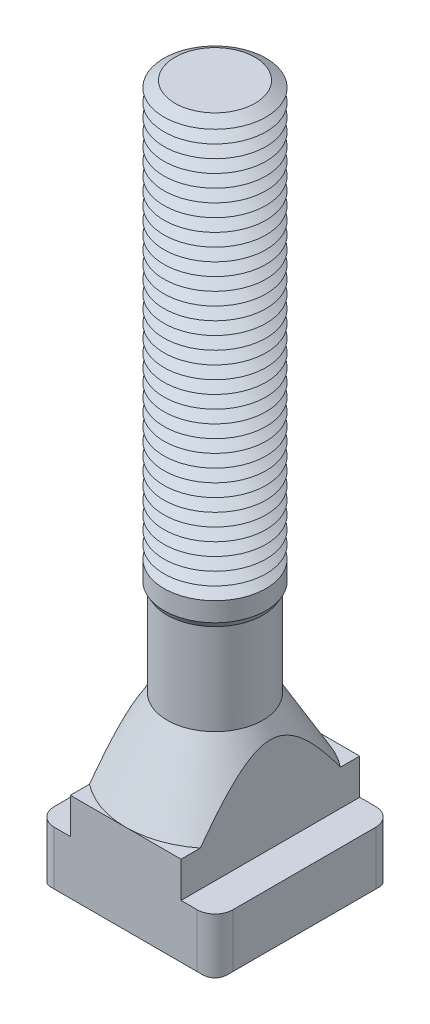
ISO-10303-21;
HEADER;
FILE_DESCRIPTION(('STEP AP214'),'2;1');
FILE_NAME('part.step','',(''),(''),'','','');
FILE_SCHEMA(('AUTOMOTIVE_DESIGN { 1 0 10303 214 1 1 1 1 }'));
ENDSEC;
DATA;
#1=APPLICATION_CONTEXT('core data for automotive mechanical design processes');
#2=APPLICATION_PROTOCOL_DEFINITION('international standard','automotive_design',2000,#1);
#3=PRODUCT_CONTEXT('',#1,'mechanical');
#4=PRODUCT('Part','Part','',(#3));
#5=PRODUCT_RELATED_PRODUCT_CATEGORY('part','',(#4));
#6=PRODUCT_DEFINITION_FORMATION('','',#4);
#7=PRODUCT_DEFINITION_CONTEXT('part definition',#1,'design');
#8=PRODUCT_DEFINITION('design','',#6,#7);
#9=PRODUCT_DEFINITION_SHAPE('','',#8);
#10=(LENGTH_UNIT() NAMED_UNIT(*) SI_UNIT(.MILLI.,.METRE.));
#11=(NAMED_UNIT(*) PLANE_ANGLE_UNIT() SI_UNIT($,.RADIAN.));
#12=(NAMED_UNIT(*) SI_UNIT($,.STERADIAN.) SOLID_ANGLE_UNIT());
#13=UNCERTAINTY_MEASURE_WITH_UNIT(LENGTH_MEASURE(1.E-05),#10,'distance_accuracy_value','');
#14=(GEOMETRIC_REPRESENTATION_CONTEXT(3) GLOBAL_UNCERTAINTY_ASSIGNED_CONTEXT((#13)) GLOBAL_UNIT_ASSIGNED_CONTEXT((#10,
#11,#12)) REPRESENTATION_CONTEXT('',''));
#15=CARTESIAN_POINT('',(0.,0.,0.));
#16=DIRECTION('',(0.,0.,1.));
#17=DIRECTION('',(1.,0.,0.));
#18=AXIS2_PLACEMENT_3D('',#15,#16,#17);
#19=CARTESIAN_POINT('',(0.,129.,0.));
#20=DIRECTION('',(0.,-1.,0.));
#21=DIRECTION('',(0.,0.,-1.));
#22=AXIS2_PLACEMENT_3D('',#19,#20,#21);
#23=CONICAL_SURFACE('',#22,7.83493649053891,1.0471975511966);
#24=CARTESIAN_POINT('',(0.,127.75,0.));
#25=DIRECTION('',(0.,-1.,0.));
#26=DIRECTION('',(0.,0.,-1.));
#27=AXIS2_PLACEMENT_3D('',#24,#25,#26);
#28=CIRCLE('',#27,10.);
#29=CARTESIAN_POINT('',(0.,127.75,-10.));
#30=VERTEX_POINT('',#29);
#31=EDGE_CURVE('E704',#30,#30,#28,.T.);
#32=ORIENTED_EDGE('',*,*,#31,.F.);
#33=EDGE_LOOP('',(#32));
#34=FACE_BOUND('',#33,.T.);
#35=CARTESIAN_POINT('',(0.,129.,0.));
#36=DIRECTION('',(0.,-1.,0.));
#37=DIRECTION('',(0.,0.,-1.));
#38=AXIS2_PLACEMENT_3D('',#35,#36,#37);
#39=CIRCLE('',#38,7.83493649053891);
#40=CARTESIAN_POINT('',(0.,129.,-7.83493649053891));
#41=VERTEX_POINT('',#40);
#42=EDGE_CURVE('E706',#41,#41,#39,.T.);
#43=ORIENTED_EDGE('',*,*,#42,.T.);
#44=EDGE_LOOP('',(#43));
#45=FACE_BOUND('',#44,.T.);
#46=ADVANCED_FACE('F39',(#34,#45),#23,.T.);
#47=CARTESIAN_POINT('',(0.,130.25,0.));
#48=DIRECTION('',(0.,1.,0.));
#49=DIRECTION('',(0.,0.,1.));
#50=AXIS2_PLACEMENT_3D('',#47,#48,#49);
#51=CONICAL_SURFACE('',#50,10.,1.0471975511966);
#52=ORIENTED_EDGE('',*,*,#42,.F.);
#53=EDGE_LOOP('',(#52));
#54=FACE_BOUND('',#53,.T.);
#55=CARTESIAN_POINT('',(0.,130.25,0.));
#56=DIRECTION('',(0.,-1.,0.));
#57=DIRECTION('',(0.,0.,-1.));
#58=AXIS2_PLACEMENT_3D('',#55,#56,#57);
#59=CIRCLE('',#58,10.);
#60=CARTESIAN_POINT('',(0.,130.25,-10.));
#61=VERTEX_POINT('',#60);
#62=EDGE_CURVE('E786',#61,#61,#59,.T.);
#63=ORIENTED_EDGE('',*,*,#62,.T.);
#64=EDGE_LOOP('',(#63));
#65=FACE_BOUND('',#64,.T.);
#66=ADVANCED_FACE('F449',(#54,#65),#51,.T.);
#67=CARTESIAN_POINT('',(4.42154108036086,139.,0.));
#68=DIRECTION('',(0.,-1.,0.));
#69=DIRECTION('',(1.,0.,0.));
#70=AXIS2_PLACEMENT_3D('',#67,#68,#69);
#71=PLANE('',#70);
#72=CARTESIAN_POINT('',(0.,139.,0.));
#73=DIRECTION('',(0.,-1.,0.));
#74=DIRECTION('',(0.,0.,-1.));
#75=AXIS2_PLACEMENT_3D('',#72,#73,#74);
#76=CIRCLE('',#75,7.83493649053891);
#77=CARTESIAN_POINT('',(0.,139.,-7.83493649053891));
#78=VERTEX_POINT('',#77);
#79=EDGE_CURVE('E666',#78,#78,#76,.T.);
#80=ORIENTED_EDGE('',*,*,#79,.F.);
#81=EDGE_LOOP('',(#80));
#82=FACE_BOUND('',#81,.T.);
#83=ADVANCED_FACE('F455',(#82),#71,.F.);
#84=CARTESIAN_POINT('',(0.,139.,0.));
#85=DIRECTION('',(0.,-1.,0.));
#86=DIRECTION('',(0.,0.,-1.));
#87=AXIS2_PLACEMENT_3D('',#84,#85,#86);
#88=CONICAL_SURFACE('',#87,7.83493649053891,1.0471975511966);
#89=CARTESIAN_POINT('',(0.,137.75,0.));
#90=DIRECTION('',(0.,-1.,0.));
#91=DIRECTION('',(0.,0.,-1.));
#92=AXIS2_PLACEMENT_3D('',#89,#90,#91);
#93=CIRCLE('',#92,10.);
#94=CARTESIAN_POINT('',(0.,137.75,-10.));
#95=VERTEX_POINT('',#94);
#96=EDGE_CURVE('E662',#95,#95,#93,.T.);
#97=ORIENTED_EDGE('',*,*,#96,.F.);
#98=EDGE_LOOP('',(#97));
#99=FACE_BOUND('',#98,.T.);
#100=ORIENTED_EDGE('',*,*,#79,.T.);
#101=EDGE_LOOP('',(#100));
#102=FACE_BOUND('',#101,.T.);
#103=ADVANCED_FACE('F483',(#99,#102),#88,.T.);
#104=CARTESIAN_POINT('',(0.,137.75,0.));
#105=DIRECTION('',(0.,1.,0.));
#106=DIRECTION('',(0.,0.,1.));
#107=AXIS2_PLACEMENT_3D('',#104,#105,#106);
#108=CONICAL_SURFACE('',#107,10.,1.0471975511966);
#109=CARTESIAN_POINT('',(0.,136.5,0.));
#110=DIRECTION('',(0.,-1.,0.));
#111=DIRECTION('',(0.,0.,-1.));
#112=AXIS2_PLACEMENT_3D('',#109,#110,#111);
#113=CIRCLE('',#112,7.83493649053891);
#114=CARTESIAN_POINT('',(0.,136.5,-7.83493649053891));
#115=VERTEX_POINT('',#114);
#116=EDGE_CURVE('E651',#115,#115,#113,.T.);
#117=ORIENTED_EDGE('',*,*,#116,.F.);
#118=EDGE_LOOP('',(#117));
#119=FACE_BOUND('',#118,.T.);
#120=ORIENTED_EDGE('',*,*,#96,.T.);
#121=EDGE_LOOP('',(#120));
#122=FACE_BOUND('',#121,.T.);
#123=ADVANCED_FACE('F480',(#119,#122),#108,.T.);
#124=CARTESIAN_POINT('',(0.,136.5,0.));
#125=DIRECTION('',(0.,-1.,0.));
#126=DIRECTION('',(0.,0.,-1.));
#127=AXIS2_PLACEMENT_3D('',#124,#125,#126);
#128=CONICAL_SURFACE('',#127,7.83493649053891,1.0471975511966);
#129=CARTESIAN_POINT('',(0.,135.25,0.));
#130=DIRECTION('',(0.,-1.,0.));
#131=DIRECTION('',(0.,0.,-1.));
#132=AXIS2_PLACEMENT_3D('',#129,#130,#131);
#133=CIRCLE('',#132,10.);
#134=CARTESIAN_POINT('',(0.,135.25,-10.));
#135=VERTEX_POINT('',#134);
#136=EDGE_CURVE('E644',#135,#135,#133,.T.);
#137=ORIENTED_EDGE('',*,*,#136,.F.);
#138=EDGE_LOOP('',(#137));
#139=FACE_BOUND('',#138,.T.);
#140=ORIENTED_EDGE('',*,*,#116,.T.);
#141=EDGE_LOOP('',(#140));
#142=FACE_BOUND('',#141,.T.);
#143=ADVANCED_FACE('F475',(#139,#142),#128,.T.);
#144=CARTESIAN_POINT('',(0.,135.25,0.));
#145=DIRECTION('',(0.,1.,0.));
#146=DIRECTION('',(0.,0.,1.));
#147=AXIS2_PLACEMENT_3D('',#144,#145,#146);
#148=CONICAL_SURFACE('',#147,10.,1.0471975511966);
#149=CARTESIAN_POINT('',(0.,134.,0.));
#150=DIRECTION('',(0.,-1.,0.));
#151=DIRECTION('',(0.,0.,-1.));
#152=AXIS2_PLACEMENT_3D('',#149,#150,#151);
#153=CIRCLE('',#152,7.83493649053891);
#154=CARTESIAN_POINT('',(0.,134.,-7.83493649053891));
#155=VERTEX_POINT('',#154);
#156=EDGE_CURVE('E642',#155,#155,#153,.T.);
#157=ORIENTED_EDGE('',*,*,#156,.F.);
#158=EDGE_LOOP('',(#157));
#159=FACE_BOUND('',#158,.T.);
#160=ORIENTED_EDGE('',*,*,#136,.T.);
#161=EDGE_LOOP('',(#160));
#162=FACE_BOUND('',#161,.T.);
#163=ADVANCED_FACE('F472',(#159,#162),#148,.T.);
#164=CARTESIAN_POINT('',(0.,134.,0.));
#165=DIRECTION('',(0.,-1.,0.));
#166=DIRECTION('',(0.,0.,-1.));
#167=AXIS2_PLACEMENT_3D('',#164,#165,#166);
#168=CONICAL_SURFACE('',#167,7.83493649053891,1.0471975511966);
#169=CARTESIAN_POINT('',(0.,132.75,0.));
#170=DIRECTION('',(0.,-1.,0.));
#171=DIRECTION('',(0.,0.,-1.));
#172=AXIS2_PLACEMENT_3D('',#169,#170,#171);
#173=CIRCLE('',#172,10.);
#174=CARTESIAN_POINT('',(0.,132.75,-10.));
#175=VERTEX_POINT('',#174);
#176=EDGE_CURVE('E645',#175,#175,#173,.T.);
#177=ORIENTED_EDGE('',*,*,#176,.F.);
#178=EDGE_LOOP('',(#177));
#179=FACE_BOUND('',#178,.T.);
#180=ORIENTED_EDGE('',*,*,#156,.T.);
#181=EDGE_LOOP('',(#180));
#182=FACE_BOUND('',#181,.T.);
#183=ADVANCED_FACE('F466',(#179,#182),#168,.T.);
#184=CARTESIAN_POINT('',(0.,132.75,0.));
#185=DIRECTION('',(0.,1.,0.));
#186=DIRECTION('',(0.,0.,1.));
#187=AXIS2_PLACEMENT_3D('',#184,#185,#186);
#188=CONICAL_SURFACE('',#187,10.,1.0471975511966);
#189=CARTESIAN_POINT('',(0.,131.5,0.));
#190=DIRECTION('',(0.,-1.,0.));
#191=DIRECTION('',(0.,0.,-1.));
#192=AXIS2_PLACEMENT_3D('',#189,#190,#191);
#193=CIRCLE('',#192,7.83493649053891);
#194=CARTESIAN_POINT('',(0.,131.5,-7.83493649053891));
#195=VERTEX_POINT('',#194);
#196=EDGE_CURVE('E655',#195,#195,#193,.T.);
#197=ORIENTED_EDGE('',*,*,#196,.F.);
#198=EDGE_LOOP('',(#197));
#199=FACE_BOUND('',#198,.T.);
#200=ORIENTED_EDGE('',*,*,#176,.T.);
#201=EDGE_LOOP('',(#200));
#202=FACE_BOUND('',#201,.T.);
#203=ADVANCED_FACE('F462',(#199,#202),#188,.T.);
#204=CARTESIAN_POINT('',(0.,131.5,0.));
#205=DIRECTION('',(0.,-1.,0.));
#206=DIRECTION('',(0.,0.,-1.));
#207=AXIS2_PLACEMENT_3D('',#204,#205,#206);
#208=CONICAL_SURFACE('',#207,7.83493649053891,1.0471975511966);
#209=ORIENTED_EDGE('',*,*,#62,.F.);
#210=EDGE_LOOP('',(#209));
#211=FACE_BOUND('',#210,.T.);
#212=ORIENTED_EDGE('',*,*,#196,.T.);
#213=EDGE_LOOP('',(#212));
#214=FACE_BOUND('',#213,.T.);
#215=ADVANCED_FACE('F465',(#211,#214),#208,.T.);
#216=CARTESIAN_POINT('',(0.,126.5,0.));
#217=DIRECTION('',(0.,-1.,0.));
#218=DIRECTION('',(0.,0.,-1.));
#219=AXIS2_PLACEMENT_3D('',#216,#217,#218);
#220=CONICAL_SURFACE('',#219,7.83493649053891,1.0471975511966);
#221=CARTESIAN_POINT('',(0.,125.25,0.));
#222=DIRECTION('',(0.,-1.,0.));
#223=DIRECTION('',(0.,0.,-1.));
#224=AXIS2_PLACEMENT_3D('',#221,#222,#223);
#225=CIRCLE('',#224,10.);
#226=CARTESIAN_POINT('',(0.,125.25,-10.));
#227=VERTEX_POINT('',#226);
#228=EDGE_CURVE('E766',#227,#227,#225,.T.);
#229=ORIENTED_EDGE('',*,*,#228,.F.);
#230=EDGE_LOOP('',(#229));
#231=FACE_BOUND('',#230,.T.);
#232=CARTESIAN_POINT('',(0.,126.5,0.));
#233=DIRECTION('',(0.,-1.,0.));
#234=DIRECTION('',(0.,0.,-1.));
#235=AXIS2_PLACEMENT_3D('',#232,#233,#234);
#236=CIRCLE('',#235,7.83493649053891);
#237=CARTESIAN_POINT('',(0.,126.5,-7.83493649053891));
#238=VERTEX_POINT('',#237);
#239=EDGE_CURVE('E707',#238,#238,#236,.T.);
#240=ORIENTED_EDGE('',*,*,#239,.T.);
#241=EDGE_LOOP('',(#240));
#242=FACE_BOUND('',#241,.T.);
#243=ADVANCED_FACE('F470',(#231,#242),#220,.T.);
#244=CARTESIAN_POINT('',(0.,127.75,0.));
#245=DIRECTION('',(0.,1.,0.));
#246=DIRECTION('',(0.,0.,1.));
#247=AXIS2_PLACEMENT_3D('',#244,#245,#246);
#248=CONICAL_SURFACE('',#247,10.,1.0471975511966);
#249=ORIENTED_EDGE('',*,*,#239,.F.);
#250=EDGE_LOOP('',(#249));
#251=FACE_BOUND('',#250,.T.);
#252=ORIENTED_EDGE('',*,*,#31,.T.);
#253=EDGE_LOOP('',(#252));
#254=FACE_BOUND('',#253,.T.);
#255=ADVANCED_FACE('F1226',(#251,#254),#248,.T.);
#256=CARTESIAN_POINT('',(0.,124.,0.));
#257=DIRECTION('',(0.,-1.,0.));
#258=DIRECTION('',(0.,0.,-1.));
#259=AXIS2_PLACEMENT_3D('',#256,#257,#258);
#260=CONICAL_SURFACE('',#259,7.83493649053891,1.0471975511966);
#261=CARTESIAN_POINT('',(0.,122.75,0.));
#262=DIRECTION('',(0.,-1.,0.));
#263=DIRECTION('',(0.,0.,-1.));
#264=AXIS2_PLACEMENT_3D('',#261,#262,#263);
#265=CIRCLE('',#264,10.);
#266=CARTESIAN_POINT('',(0.,122.75,-10.));
#267=VERTEX_POINT('',#266);
#268=EDGE_CURVE('E767',#267,#267,#265,.T.);
#269=ORIENTED_EDGE('',*,*,#268,.F.);
#270=EDGE_LOOP('',(#269));
#271=FACE_BOUND('',#270,.T.);
#272=CARTESIAN_POINT('',(0.,124.,0.));
#273=DIRECTION('',(0.,-1.,0.));
#274=DIRECTION('',(0.,0.,-1.));
#275=AXIS2_PLACEMENT_3D('',#272,#273,#274);
#276=CIRCLE('',#275,7.83493649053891);
#277=CARTESIAN_POINT('',(0.,124.,-7.83493649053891));
#278=VERTEX_POINT('',#277);
#279=EDGE_CURVE('E764',#278,#278,#276,.T.);
#280=ORIENTED_EDGE('',*,*,#279,.T.);
#281=EDGE_LOOP('',(#280));
#282=FACE_BOUND('',#281,.T.);
#283=ADVANCED_FACE('F1222',(#271,#282),#260,.T.);
#284=CARTESIAN_POINT('',(0.,125.25,0.));
#285=DIRECTION('',(0.,1.,0.));
#286=DIRECTION('',(0.,0.,1.));
#287=AXIS2_PLACEMENT_3D('',#284,#285,#286);
#288=CONICAL_SURFACE('',#287,10.,1.0471975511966);
#289=ORIENTED_EDGE('',*,*,#279,.F.);
#290=EDGE_LOOP('',(#289));
#291=FACE_BOUND('',#290,.T.);
#292=ORIENTED_EDGE('',*,*,#228,.T.);
#293=EDGE_LOOP('',(#292));
#294=FACE_BOUND('',#293,.T.);
#295=ADVANCED_FACE('F1218',(#291,#294),#288,.T.);
#296=CARTESIAN_POINT('',(0.,121.5,0.));
#297=DIRECTION('',(0.,-1.,0.));
#298=DIRECTION('',(0.,0.,-1.));
#299=AXIS2_PLACEMENT_3D('',#296,#297,#298);
#300=CONICAL_SURFACE('',#299,7.83493649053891,1.0471975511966);
#301=CARTESIAN_POINT('',(0.,120.25,0.));
#302=DIRECTION('',(0.,-1.,0.));
#303=DIRECTION('',(0.,0.,-1.));
#304=AXIS2_PLACEMENT_3D('',#301,#302,#303);
#305=CIRCLE('',#304,10.);
#306=CARTESIAN_POINT('',(0.,120.25,-10.));
#307=VERTEX_POINT('',#306);
#308=EDGE_CURVE('E731',#307,#307,#305,.T.);
#309=ORIENTED_EDGE('',*,*,#308,.F.);
#310=EDGE_LOOP('',(#309));
#311=FACE_BOUND('',#310,.T.);
#312=CARTESIAN_POINT('',(0.,121.5,0.));
#313=DIRECTION('',(0.,-1.,0.));
#314=DIRECTION('',(0.,0.,-1.));
#315=AXIS2_PLACEMENT_3D('',#312,#313,#314);
#316=CIRCLE('',#315,7.83493649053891);
#317=CARTESIAN_POINT('',(0.,121.5,-7.83493649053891));
#318=VERTEX_POINT('',#317);
#319=EDGE_CURVE('E776',#318,#318,#316,.T.);
#320=ORIENTED_EDGE('',*,*,#319,.T.);
#321=EDGE_LOOP('',(#320));
#322=FACE_BOUND('',#321,.T.);
#323=ADVANCED_FACE('F1214',(#311,#322),#300,.T.);
#324=CARTESIAN_POINT('',(0.,122.75,0.));
#325=DIRECTION('',(0.,1.,0.));
#326=DIRECTION('',(0.,0.,1.));
#327=AXIS2_PLACEMENT_3D('',#324,#325,#326);
#328=CONICAL_SURFACE('',#327,10.,1.0471975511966);
#329=ORIENTED_EDGE('',*,*,#319,.F.);
#330=EDGE_LOOP('',(#329));
#331=FACE_BOUND('',#330,.T.);
#332=ORIENTED_EDGE('',*,*,#268,.T.);
#333=EDGE_LOOP('',(#332));
#334=FACE_BOUND('',#333,.T.);
#335=ADVANCED_FACE('F1203',(#331,#334),#328,.T.);
#336=CARTESIAN_POINT('',(0.,119.,0.));
#337=DIRECTION('',(0.,-1.,0.));
#338=DIRECTION('',(0.,0.,-1.));
#339=AXIS2_PLACEMENT_3D('',#336,#337,#338);
#340=CONICAL_SURFACE('',#339,7.83493649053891,1.0471975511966);
#341=CARTESIAN_POINT('',(0.,117.75,0.));
#342=DIRECTION('',(0.,-1.,0.));
#343=DIRECTION('',(0.,0.,-1.));
#344=AXIS2_PLACEMENT_3D('',#341,#342,#343);
#345=CIRCLE('',#344,10.);
#346=CARTESIAN_POINT('',(0.,117.75,-10.));
#347=VERTEX_POINT('',#346);
#348=EDGE_CURVE('E732',#347,#347,#345,.T.);
#349=ORIENTED_EDGE('',*,*,#348,.F.);
#350=EDGE_LOOP('',(#349));
#351=FACE_BOUND('',#350,.T.);
#352=CARTESIAN_POINT('',(0.,119.,0.));
#353=DIRECTION('',(0.,-1.,0.));
#354=DIRECTION('',(0.,0.,-1.));
#355=AXIS2_PLACEMENT_3D('',#352,#353,#354);
#356=CIRCLE('',#355,7.83493649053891);
#357=CARTESIAN_POINT('',(0.,119.,-7.83493649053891));
#358=VERTEX_POINT('',#357);
#359=EDGE_CURVE('E728',#358,#358,#356,.T.);
#360=ORIENTED_EDGE('',*,*,#359,.T.);
#361=EDGE_LOOP('',(#360));
#362=FACE_BOUND('',#361,.T.);
#363=ADVANCED_FACE('F1200',(#351,#362),#340,.T.);
#364=CARTESIAN_POINT('',(0.,120.25,0.));
#365=DIRECTION('',(0.,1.,0.));
#366=DIRECTION('',(0.,0.,1.));
#367=AXIS2_PLACEMENT_3D('',#364,#365,#366);
#368=CONICAL_SURFACE('',#367,10.,1.0471975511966);
#369=ORIENTED_EDGE('',*,*,#359,.F.);
#370=EDGE_LOOP('',(#369));
#371=FACE_BOUND('',#370,.T.);
#372=ORIENTED_EDGE('',*,*,#308,.T.);
#373=EDGE_LOOP('',(#372));
#374=FACE_BOUND('',#373,.T.);
#375=ADVANCED_FACE('F1191',(#371,#374),#368,.T.);
#376=CARTESIAN_POINT('',(0.,116.5,0.));
#377=DIRECTION('',(0.,-1.,0.));
#378=DIRECTION('',(0.,0.,-1.));
#379=AXIS2_PLACEMENT_3D('',#376,#377,#378);
#380=CONICAL_SURFACE('',#379,7.83493649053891,1.0471975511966);
#381=CARTESIAN_POINT('',(0.,115.25,0.));
#382=DIRECTION('',(0.,-1.,0.));
#383=DIRECTION('',(0.,0.,-1.));
#384=AXIS2_PLACEMENT_3D('',#381,#382,#383);
#385=CIRCLE('',#384,10.);
#386=CARTESIAN_POINT('',(0.,115.25,-10.));
#387=VERTEX_POINT('',#386);
#388=EDGE_CURVE('E722',#387,#387,#385,.T.);
#389=ORIENTED_EDGE('',*,*,#388,.F.);
#390=EDGE_LOOP('',(#389));
#391=FACE_BOUND('',#390,.T.);
#392=CARTESIAN_POINT('',(0.,116.5,0.));
#393=DIRECTION('',(0.,-1.,0.));
#394=DIRECTION('',(0.,0.,-1.));
#395=AXIS2_PLACEMENT_3D('',#392,#393,#394);
#396=CIRCLE('',#395,7.83493649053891);
#397=CARTESIAN_POINT('',(0.,116.5,-7.83493649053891));
#398=VERTEX_POINT('',#397);
#399=EDGE_CURVE('E725',#398,#398,#396,.T.);
#400=ORIENTED_EDGE('',*,*,#399,.T.);
#401=EDGE_LOOP('',(#400));
#402=FACE_BOUND('',#401,.T.);
#403=ADVANCED_FACE('F1188',(#391,#402),#380,.T.);
#404=CARTESIAN_POINT('',(0.,117.75,0.));
#405=DIRECTION('',(0.,1.,0.));
#406=DIRECTION('',(0.,0.,1.));
#407=AXIS2_PLACEMENT_3D('',#404,#405,#406);
#408=CONICAL_SURFACE('',#407,10.,1.0471975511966);
#409=ORIENTED_EDGE('',*,*,#399,.F.);
#410=EDGE_LOOP('',(#409));
#411=FACE_BOUND('',#410,.T.);
#412=ORIENTED_EDGE('',*,*,#348,.T.);
#413=EDGE_LOOP('',(#412));
#414=FACE_BOUND('',#413,.T.);
#415=ADVANCED_FACE('F1179',(#411,#414),#408,.T.);
#416=CARTESIAN_POINT('',(0.,114.,0.));
#417=DIRECTION('',(0.,-1.,0.));
#418=DIRECTION('',(0.,0.,-1.));
#419=AXIS2_PLACEMENT_3D('',#416,#417,#418);
#420=CONICAL_SURFACE('',#419,7.83493649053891,1.0471975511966);
#421=CARTESIAN_POINT('',(0.,112.75,0.));
#422=DIRECTION('',(0.,-1.,0.));
#423=DIRECTION('',(0.,0.,-1.));
#424=AXIS2_PLACEMENT_3D('',#421,#422,#423);
#425=CIRCLE('',#424,10.);
#426=CARTESIAN_POINT('',(0.,112.75,-10.));
#427=VERTEX_POINT('',#426);
#428=EDGE_CURVE('E804',#427,#427,#425,.T.);
#429=ORIENTED_EDGE('',*,*,#428,.F.);
#430=EDGE_LOOP('',(#429));
#431=FACE_BOUND('',#430,.T.);
#432=CARTESIAN_POINT('',(0.,114.,0.));
#433=DIRECTION('',(0.,-1.,0.));
#434=DIRECTION('',(0.,0.,-1.));
#435=AXIS2_PLACEMENT_3D('',#432,#433,#434);
#436=CIRCLE('',#435,7.83493649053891);
#437=CARTESIAN_POINT('',(0.,114.,-7.83493649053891));
#438=VERTEX_POINT('',#437);
#439=EDGE_CURVE('E726',#438,#438,#436,.T.);
#440=ORIENTED_EDGE('',*,*,#439,.T.);
#441=EDGE_LOOP('',(#440));
#442=FACE_BOUND('',#441,.T.);
#443=ADVANCED_FACE('F1176',(#431,#442),#420,.T.);
#444=CARTESIAN_POINT('',(0.,115.25,0.));
#445=DIRECTION('',(0.,1.,0.));
#446=DIRECTION('',(0.,0.,1.));
#447=AXIS2_PLACEMENT_3D('',#444,#445,#446);
#448=CONICAL_SURFACE('',#447,10.,1.0471975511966);
#449=ORIENTED_EDGE('',*,*,#439,.F.);
#450=EDGE_LOOP('',(#449));
#451=FACE_BOUND('',#450,.T.);
#452=ORIENTED_EDGE('',*,*,#388,.T.);
#453=EDGE_LOOP('',(#452));
#454=FACE_BOUND('',#453,.T.);
#455=ADVANCED_FACE('F1167',(#451,#454),#448,.T.);
#456=CARTESIAN_POINT('',(0.,111.5,0.));
#457=DIRECTION('',(0.,-1.,0.));
#458=DIRECTION('',(0.,0.,-1.));
#459=AXIS2_PLACEMENT_3D('',#456,#457,#458);
#460=CONICAL_SURFACE('',#459,7.83493649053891,1.0471975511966);
#461=CARTESIAN_POINT('',(0.,110.25,0.));
#462=DIRECTION('',(0.,-1.,0.));
#463=DIRECTION('',(0.,0.,-1.));
#464=AXIS2_PLACEMENT_3D('',#461,#462,#463);
#465=CIRCLE('',#464,10.);
#466=CARTESIAN_POINT('',(0.,110.25,-10.));
#467=VERTEX_POINT('',#466);
#468=EDGE_CURVE('E639',#467,#467,#465,.T.);
#469=ORIENTED_EDGE('',*,*,#468,.F.);
#470=EDGE_LOOP('',(#469));
#471=FACE_BOUND('',#470,.T.);
#472=CARTESIAN_POINT('',(0.,111.5,0.));
#473=DIRECTION('',(0.,-1.,0.));
#474=DIRECTION('',(0.,0.,-1.));
#475=AXIS2_PLACEMENT_3D('',#472,#473,#474);
#476=CIRCLE('',#475,7.83493649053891);
#477=CARTESIAN_POINT('',(0.,111.5,-7.83493649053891));
#478=VERTEX_POINT('',#477);
#479=EDGE_CURVE('E806',#478,#478,#476,.T.);
#480=ORIENTED_EDGE('',*,*,#479,.T.);
#481=EDGE_LOOP('',(#480));
#482=FACE_BOUND('',#481,.T.);
#483=ADVANCED_FACE('F1164',(#471,#482),#460,.T.);
#484=CARTESIAN_POINT('',(0.,112.75,0.));
#485=DIRECTION('',(0.,1.,0.));
#486=DIRECTION('',(0.,0.,1.));
#487=AXIS2_PLACEMENT_3D('',#484,#485,#486);
#488=CONICAL_SURFACE('',#487,10.,1.0471975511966);
#489=ORIENTED_EDGE('',*,*,#479,.F.);
#490=EDGE_LOOP('',(#489));
#491=FACE_BOUND('',#490,.T.);
#492=ORIENTED_EDGE('',*,*,#428,.T.);
#493=EDGE_LOOP('',(#492));
#494=FACE_BOUND('',#493,.T.);
#495=ADVANCED_FACE('F1155',(#491,#494),#488,.T.);
#496=CARTESIAN_POINT('',(0.,109.,0.));
#497=DIRECTION('',(0.,-1.,0.));
#498=DIRECTION('',(0.,0.,-1.));
#499=AXIS2_PLACEMENT_3D('',#496,#497,#498);
#500=CONICAL_SURFACE('',#499,7.83493649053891,1.0471975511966);
#501=CARTESIAN_POINT('',(0.,107.75,0.));
#502=DIRECTION('',(0.,-1.,0.));
#503=DIRECTION('',(0.,0.,-1.));
#504=AXIS2_PLACEMENT_3D('',#501,#502,#503);
#505=CIRCLE('',#504,10.);
#506=CARTESIAN_POINT('',(0.,107.75,-10.));
#507=VERTEX_POINT('',#506);
#508=EDGE_CURVE('E640',#507,#507,#505,.T.);
#509=ORIENTED_EDGE('',*,*,#508,.F.);
#510=EDGE_LOOP('',(#509));
#511=FACE_BOUND('',#510,.T.);
#512=CARTESIAN_POINT('',(0.,109.,0.));
#513=DIRECTION('',(0.,-1.,0.));
#514=DIRECTION('',(0.,0.,-1.));
#515=AXIS2_PLACEMENT_3D('',#512,#513,#514);
#516=CIRCLE('',#515,7.83493649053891);
#517=CARTESIAN_POINT('',(0.,109.,-7.83493649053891));
#518=VERTEX_POINT('',#517);
#519=EDGE_CURVE('E636',#518,#518,#516,.T.);
#520=ORIENTED_EDGE('',*,*,#519,.T.);
#521=EDGE_LOOP('',(#520));
#522=FACE_BOUND('',#521,.T.);
#523=ADVANCED_FACE('F1152',(#511,#522),#500,.T.);
#524=CARTESIAN_POINT('',(0.,110.25,0.));
#525=DIRECTION('',(0.,1.,0.));
#526=DIRECTION('',(0.,0.,1.));
#527=AXIS2_PLACEMENT_3D('',#524,#525,#526);
#528=CONICAL_SURFACE('',#527,10.,1.0471975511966);
#529=ORIENTED_EDGE('',*,*,#519,.F.);
#530=EDGE_LOOP('',(#529));
#531=FACE_BOUND('',#530,.T.);
#532=ORIENTED_EDGE('',*,*,#468,.T.);
#533=EDGE_LOOP('',(#532));
#534=FACE_BOUND('',#533,.T.);
#535=ADVANCED_FACE('F1143',(#531,#534),#528,.T.);
#536=CARTESIAN_POINT('',(0.,106.5,0.));
#537=DIRECTION('',(0.,-1.,0.));
#538=DIRECTION('',(0.,0.,-1.));
#539=AXIS2_PLACEMENT_3D('',#536,#537,#538);
#540=CONICAL_SURFACE('',#539,7.83493649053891,1.0471975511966);
#541=CARTESIAN_POINT('',(0.,105.25,0.));
#542=DIRECTION('',(0.,-1.,0.));
#543=DIRECTION('',(0.,0.,-1.));
#544=AXIS2_PLACEMENT_3D('',#541,#542,#543);
#545=CIRCLE('',#544,10.);
#546=CARTESIAN_POINT('',(0.,105.25,-10.));
#547=VERTEX_POINT('',#546);
#548=EDGE_CURVE('E817',#547,#547,#545,.T.);
#549=ORIENTED_EDGE('',*,*,#548,.F.);
#550=EDGE_LOOP('',(#549));
#551=FACE_BOUND('',#550,.T.);
#552=CARTESIAN_POINT('',(0.,106.5,0.));
#553=DIRECTION('',(0.,-1.,0.));
#554=DIRECTION('',(0.,0.,-1.));
#555=AXIS2_PLACEMENT_3D('',#552,#553,#554);
#556=CIRCLE('',#555,7.83493649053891);
#557=CARTESIAN_POINT('',(0.,106.5,-7.83493649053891));
#558=VERTEX_POINT('',#557);
#559=EDGE_CURVE('E851',#558,#558,#556,.T.);
#560=ORIENTED_EDGE('',*,*,#559,.T.);
#561=EDGE_LOOP('',(#560));
#562=FACE_BOUND('',#561,.T.);
#563=ADVANCED_FACE('F1140',(#551,#562),#540,.T.);
#564=CARTESIAN_POINT('',(0.,107.75,0.));
#565=DIRECTION('',(0.,1.,0.));
#566=DIRECTION('',(0.,0.,1.));
#567=AXIS2_PLACEMENT_3D('',#564,#565,#566);
#568=CONICAL_SURFACE('',#567,10.,1.0471975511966);
#569=ORIENTED_EDGE('',*,*,#559,.F.);
#570=EDGE_LOOP('',(#569));
#571=FACE_BOUND('',#570,.T.);
#572=ORIENTED_EDGE('',*,*,#508,.T.);
#573=EDGE_LOOP('',(#572));
#574=FACE_BOUND('',#573,.T.);
#575=ADVANCED_FACE('F1131',(#571,#574),#568,.T.);
#576=CARTESIAN_POINT('',(0.,104.,0.));
#577=DIRECTION('',(0.,-1.,0.));
#578=DIRECTION('',(0.,0.,-1.));
#579=AXIS2_PLACEMENT_3D('',#576,#577,#578);
#580=CONICAL_SURFACE('',#579,7.83493649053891,1.0471975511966);
#581=CARTESIAN_POINT('',(0.,102.75,0.));
#582=DIRECTION('',(0.,-1.,0.));
#583=DIRECTION('',(0.,0.,-1.));
#584=AXIS2_PLACEMENT_3D('',#581,#582,#583);
#585=CIRCLE('',#584,10.);
#586=CARTESIAN_POINT('',(0.,102.75,-10.));
#587=VERTEX_POINT('',#586);
#588=EDGE_CURVE('E700',#587,#587,#585,.T.);
#589=ORIENTED_EDGE('',*,*,#588,.F.);
#590=EDGE_LOOP('',(#589));
#591=FACE_BOUND('',#590,.T.);
#592=CARTESIAN_POINT('',(0.,104.,0.));
#593=DIRECTION('',(0.,-1.,0.));
#594=DIRECTION('',(0.,0.,-1.));
#595=AXIS2_PLACEMENT_3D('',#592,#593,#594);
#596=CIRCLE('',#595,7.83493649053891);
#597=CARTESIAN_POINT('',(0.,104.,-7.83493649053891));
#598=VERTEX_POINT('',#597);
#599=EDGE_CURVE('E748',#598,#598,#596,.T.);
#600=ORIENTED_EDGE('',*,*,#599,.T.);
#601=EDGE_LOOP('',(#600));
#602=FACE_BOUND('',#601,.T.);
#603=ADVANCED_FACE('F1128',(#591,#602),#580,.T.);
#604=CARTESIAN_POINT('',(0.,105.25,0.));
#605=DIRECTION('',(0.,1.,0.));
#606=DIRECTION('',(0.,0.,1.));
#607=AXIS2_PLACEMENT_3D('',#604,#605,#606);
#608=CONICAL_SURFACE('',#607,10.,1.0471975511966);
#609=ORIENTED_EDGE('',*,*,#599,.F.);
#610=EDGE_LOOP('',(#609));
#611=FACE_BOUND('',#610,.T.);
#612=ORIENTED_EDGE('',*,*,#548,.T.);
#613=EDGE_LOOP('',(#612));
#614=FACE_BOUND('',#613,.T.);
#615=ADVANCED_FACE('F1119',(#611,#614),#608,.T.);
#616=CARTESIAN_POINT('',(0.,101.5,0.));
#617=DIRECTION('',(0.,-1.,0.));
#618=DIRECTION('',(0.,0.,-1.));
#619=AXIS2_PLACEMENT_3D('',#616,#617,#618);
#620=CONICAL_SURFACE('',#619,7.83493649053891,1.0471975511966);
#621=CARTESIAN_POINT('',(0.,100.25,0.));
#622=DIRECTION('',(0.,-1.,0.));
#623=DIRECTION('',(0.,0.,-1.));
#624=AXIS2_PLACEMENT_3D('',#621,#622,#623);
#625=CIRCLE('',#624,10.);
#626=CARTESIAN_POINT('',(0.,100.25,-10.));
#627=VERTEX_POINT('',#626);
#628=EDGE_CURVE('E701',#627,#627,#625,.T.);
#629=ORIENTED_EDGE('',*,*,#628,.F.);
#630=EDGE_LOOP('',(#629));
#631=FACE_BOUND('',#630,.T.);
#632=CARTESIAN_POINT('',(0.,101.5,0.));
#633=DIRECTION('',(0.,-1.,0.));
#634=DIRECTION('',(0.,0.,-1.));
#635=AXIS2_PLACEMENT_3D('',#632,#633,#634);
#636=CIRCLE('',#635,7.83493649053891);
#637=CARTESIAN_POINT('',(0.,101.5,-7.83493649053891));
#638=VERTEX_POINT('',#637);
#639=EDGE_CURVE('E698',#638,#638,#636,.T.);
#640=ORIENTED_EDGE('',*,*,#639,.T.);
#641=EDGE_LOOP('',(#640));
#642=FACE_BOUND('',#641,.T.);
#643=ADVANCED_FACE('F1116',(#631,#642),#620,.T.);
#644=CARTESIAN_POINT('',(0.,102.75,0.));
#645=DIRECTION('',(0.,1.,0.));
#646=DIRECTION('',(0.,0.,1.));
#647=AXIS2_PLACEMENT_3D('',#644,#645,#646);
#648=CONICAL_SURFACE('',#647,10.,1.0471975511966);
#649=ORIENTED_EDGE('',*,*,#639,.F.);
#650=EDGE_LOOP('',(#649));
#651=FACE_BOUND('',#650,.T.);
#652=ORIENTED_EDGE('',*,*,#588,.T.);
#653=EDGE_LOOP('',(#652));
#654=FACE_BOUND('',#653,.T.);
#655=ADVANCED_FACE('F1107',(#651,#654),#648,.T.);
#656=CARTESIAN_POINT('',(0.,99.,0.));
#657=DIRECTION('',(0.,-1.,0.));
#658=DIRECTION('',(0.,0.,-1.));
#659=AXIS2_PLACEMENT_3D('',#656,#657,#658);
#660=CONICAL_SURFACE('',#659,7.83493649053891,1.0471975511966);
#661=CARTESIAN_POINT('',(0.,97.75,0.));
#662=DIRECTION('',(0.,-1.,0.));
#663=DIRECTION('',(0.,0.,-1.));
#664=AXIS2_PLACEMENT_3D('',#661,#662,#663);
#665=CIRCLE('',#664,10.);
#666=CARTESIAN_POINT('',(0.,97.75,-10.));
#667=VERTEX_POINT('',#666);
#668=EDGE_CURVE('E692',#667,#667,#665,.T.);
#669=ORIENTED_EDGE('',*,*,#668,.F.);
#670=EDGE_LOOP('',(#669));
#671=FACE_BOUND('',#670,.T.);
#672=CARTESIAN_POINT('',(0.,99.,0.));
#673=DIRECTION('',(0.,-1.,0.));
#674=DIRECTION('',(0.,0.,-1.));
#675=AXIS2_PLACEMENT_3D('',#672,#673,#674);
#676=CIRCLE('',#675,7.83493649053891);
#677=CARTESIAN_POINT('',(0.,99.,-7.83493649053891));
#678=VERTEX_POINT('',#677);
#679=EDGE_CURVE('E695',#678,#678,#676,.T.);
#680=ORIENTED_EDGE('',*,*,#679,.T.);
#681=EDGE_LOOP('',(#680));
#682=FACE_BOUND('',#681,.T.);
#683=ADVANCED_FACE('F1104',(#671,#682),#660,.T.);
#684=CARTESIAN_POINT('',(0.,100.25,0.));
#685=DIRECTION('',(0.,1.,0.));
#686=DIRECTION('',(0.,0.,1.));
#687=AXIS2_PLACEMENT_3D('',#684,#685,#686);
#688=CONICAL_SURFACE('',#687,10.,1.0471975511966);
#689=ORIENTED_EDGE('',*,*,#679,.F.);
#690=EDGE_LOOP('',(#689));
#691=FACE_BOUND('',#690,.T.);
#692=ORIENTED_EDGE('',*,*,#628,.T.);
#693=EDGE_LOOP('',(#692));
#694=FACE_BOUND('',#693,.T.);
#695=ADVANCED_FACE('F1095',(#691,#694),#688,.T.);
#696=CARTESIAN_POINT('',(0.,96.5,0.));
#697=DIRECTION('',(0.,-1.,0.));
#698=DIRECTION('',(0.,0.,-1.));
#699=AXIS2_PLACEMENT_3D('',#696,#697,#698);
#700=CONICAL_SURFACE('',#699,7.83493649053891,1.0471975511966);
#701=CARTESIAN_POINT('',(0.,95.25,0.));
#702=DIRECTION('',(0.,-1.,0.));
#703=DIRECTION('',(0.,0.,-1.));
#704=AXIS2_PLACEMENT_3D('',#701,#702,#703);
#705=CIRCLE('',#704,10.);
#706=CARTESIAN_POINT('',(0.,95.25,-10.));
#707=VERTEX_POINT('',#706);
#708=EDGE_CURVE('E761',#707,#707,#705,.T.);
#709=ORIENTED_EDGE('',*,*,#708,.F.);
#710=EDGE_LOOP('',(#709));
#711=FACE_BOUND('',#710,.T.);
#712=CARTESIAN_POINT('',(0.,96.5,0.));
#713=DIRECTION('',(0.,-1.,0.));
#714=DIRECTION('',(0.,0.,-1.));
#715=AXIS2_PLACEMENT_3D('',#712,#713,#714);
#716=CIRCLE('',#715,7.83493649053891);
#717=CARTESIAN_POINT('',(0.,96.5,-7.83493649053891));
#718=VERTEX_POINT('',#717);
#719=EDGE_CURVE('E696',#718,#718,#716,.T.);
#720=ORIENTED_EDGE('',*,*,#719,.T.);
#721=EDGE_LOOP('',(#720));
#722=FACE_BOUND('',#721,.T.);
#723=ADVANCED_FACE('F1092',(#711,#722),#700,.T.);
#724=CARTESIAN_POINT('',(0.,97.75,0.));
#725=DIRECTION('',(0.,1.,0.));
#726=DIRECTION('',(0.,0.,1.));
#727=AXIS2_PLACEMENT_3D('',#724,#725,#726);
#728=CONICAL_SURFACE('',#727,10.,1.0471975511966);
#729=ORIENTED_EDGE('',*,*,#719,.F.);
#730=EDGE_LOOP('',(#729));
#731=FACE_BOUND('',#730,.T.);
#732=ORIENTED_EDGE('',*,*,#668,.T.);
#733=EDGE_LOOP('',(#732));
#734=FACE_BOUND('',#733,.T.);
#735=ADVANCED_FACE('F1083',(#731,#734),#728,.T.);
#736=CARTESIAN_POINT('',(0.,94.,0.));
#737=DIRECTION('',(0.,-1.,0.));
#738=DIRECTION('',(0.,0.,-1.));
#739=AXIS2_PLACEMENT_3D('',#736,#737,#738);
#740=CONICAL_SURFACE('',#739,7.83493649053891,1.0471975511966);
#741=CARTESIAN_POINT('',(0.,92.75,0.));
#742=DIRECTION('',(0.,-1.,0.));
#743=DIRECTION('',(0.,0.,-1.));
#744=AXIS2_PLACEMENT_3D('',#741,#742,#743);
#745=CIRCLE('',#744,10.);
#746=CARTESIAN_POINT('',(0.,92.75,-10.));
#747=VERTEX_POINT('',#746);
#748=EDGE_CURVE('E762',#747,#747,#745,.T.);
#749=ORIENTED_EDGE('',*,*,#748,.F.);
#750=EDGE_LOOP('',(#749));
#751=FACE_BOUND('',#750,.T.);
#752=CARTESIAN_POINT('',(0.,94.,0.));
#753=DIRECTION('',(0.,-1.,0.));
#754=DIRECTION('',(0.,0.,-1.));
#755=AXIS2_PLACEMENT_3D('',#752,#753,#754);
#756=CIRCLE('',#755,7.83493649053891);
#757=CARTESIAN_POINT('',(0.,94.,-7.83493649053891));
#758=VERTEX_POINT('',#757);
#759=EDGE_CURVE('E759',#758,#758,#756,.T.);
#760=ORIENTED_EDGE('',*,*,#759,.T.);
#761=EDGE_LOOP('',(#760));
#762=FACE_BOUND('',#761,.T.);
#763=ADVANCED_FACE('F1080',(#751,#762),#740,.T.);
#764=CARTESIAN_POINT('',(0.,95.25,0.));
#765=DIRECTION('',(0.,1.,0.));
#766=DIRECTION('',(0.,0.,1.));
#767=AXIS2_PLACEMENT_3D('',#764,#765,#766);
#768=CONICAL_SURFACE('',#767,10.,1.0471975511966);
#769=ORIENTED_EDGE('',*,*,#759,.F.);
#770=EDGE_LOOP('',(#769));
#771=FACE_BOUND('',#770,.T.);
#772=ORIENTED_EDGE('',*,*,#708,.T.);
#773=EDGE_LOOP('',(#772));
#774=FACE_BOUND('',#773,.T.);
#775=ADVANCED_FACE('F1071',(#771,#774),#768,.T.);
#776=CARTESIAN_POINT('',(0.,91.5,0.));
#777=DIRECTION('',(0.,-1.,0.));
#778=DIRECTION('',(0.,0.,-1.));
#779=AXIS2_PLACEMENT_3D('',#776,#777,#778);
#780=CONICAL_SURFACE('',#779,7.83493649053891,1.0471975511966);
#781=CARTESIAN_POINT('',(0.,90.25,0.));
#782=DIRECTION('',(0.,-1.,0.));
#783=DIRECTION('',(0.,0.,-1.));
#784=AXIS2_PLACEMENT_3D('',#781,#782,#783);
#785=CIRCLE('',#784,10.);
#786=CARTESIAN_POINT('',(0.,90.25,-10.));
#787=VERTEX_POINT('',#786);
#788=EDGE_CURVE('E719',#787,#787,#785,.T.);
#789=ORIENTED_EDGE('',*,*,#788,.F.);
#790=EDGE_LOOP('',(#789));
#791=FACE_BOUND('',#790,.T.);
#792=CARTESIAN_POINT('',(0.,91.5,0.));
#793=DIRECTION('',(0.,-1.,0.));
#794=DIRECTION('',(0.,0.,-1.));
#795=AXIS2_PLACEMENT_3D('',#792,#793,#794);
#796=CIRCLE('',#795,7.83493649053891);
#797=CARTESIAN_POINT('',(0.,91.5,-7.83493649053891));
#798=VERTEX_POINT('',#797);
#799=EDGE_CURVE('E828',#798,#798,#796,.T.);
#800=ORIENTED_EDGE('',*,*,#799,.T.);
#801=EDGE_LOOP('',(#800));
#802=FACE_BOUND('',#801,.T.);
#803=ADVANCED_FACE('F1068',(#791,#802),#780,.T.);
#804=CARTESIAN_POINT('',(0.,92.75,0.));
#805=DIRECTION('',(0.,1.,0.));
#806=DIRECTION('',(0.,0.,1.));
#807=AXIS2_PLACEMENT_3D('',#804,#805,#806);
#808=CONICAL_SURFACE('',#807,10.,1.0471975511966);
#809=ORIENTED_EDGE('',*,*,#799,.F.);
#810=EDGE_LOOP('',(#809));
#811=FACE_BOUND('',#810,.T.);
#812=ORIENTED_EDGE('',*,*,#748,.T.);
#813=EDGE_LOOP('',(#812));
#814=FACE_BOUND('',#813,.T.);
#815=ADVANCED_FACE('F1059',(#811,#814),#808,.T.);
#816=CARTESIAN_POINT('',(0.,89.,0.));
#817=DIRECTION('',(0.,-1.,0.));
#818=DIRECTION('',(0.,0.,-1.));
#819=AXIS2_PLACEMENT_3D('',#816,#817,#818);
#820=CONICAL_SURFACE('',#819,7.83493649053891,1.0471975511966);
#821=CARTESIAN_POINT('',(0.,87.75,0.));
#822=DIRECTION('',(0.,-1.,0.));
#823=DIRECTION('',(0.,0.,-1.));
#824=AXIS2_PLACEMENT_3D('',#821,#822,#823);
#825=CIRCLE('',#824,10.);
#826=CARTESIAN_POINT('',(0.,87.75,-10.));
#827=VERTEX_POINT('',#826);
#828=EDGE_CURVE('E720',#827,#827,#825,.T.);
#829=ORIENTED_EDGE('',*,*,#828,.F.);
#830=EDGE_LOOP('',(#829));
#831=FACE_BOUND('',#830,.T.);
#832=CARTESIAN_POINT('',(0.,89.,0.));
#833=DIRECTION('',(0.,-1.,0.));
#834=DIRECTION('',(0.,0.,-1.));
#835=AXIS2_PLACEMENT_3D('',#832,#833,#834);
#836=CIRCLE('',#835,7.83493649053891);
#837=CARTESIAN_POINT('',(0.,89.,-7.83493649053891));
#838=VERTEX_POINT('',#837);
#839=EDGE_CURVE('E716',#838,#838,#836,.T.);
#840=ORIENTED_EDGE('',*,*,#839,.T.);
#841=EDGE_LOOP('',(#840));
#842=FACE_BOUND('',#841,.T.);
#843=ADVANCED_FACE('F1056',(#831,#842),#820,.T.);
#844=CARTESIAN_POINT('',(0.,90.25,0.));
#845=DIRECTION('',(0.,1.,0.));
#846=DIRECTION('',(0.,0.,1.));
#847=AXIS2_PLACEMENT_3D('',#844,#845,#846);
#848=CONICAL_SURFACE('',#847,10.,1.0471975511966);
#849=ORIENTED_EDGE('',*,*,#839,.F.);
#850=EDGE_LOOP('',(#849));
#851=FACE_BOUND('',#850,.T.);
#852=ORIENTED_EDGE('',*,*,#788,.T.);
#853=EDGE_LOOP('',(#852));
#854=FACE_BOUND('',#853,.T.);
#855=ADVANCED_FACE('F1047',(#851,#854),#848,.T.);
#856=CARTESIAN_POINT('',(0.,86.5,0.));
#857=DIRECTION('',(0.,-1.,0.));
#858=DIRECTION('',(0.,0.,-1.));
#859=AXIS2_PLACEMENT_3D('',#856,#857,#858);
#860=CONICAL_SURFACE('',#859,7.83493649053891,1.0471975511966);
#861=CARTESIAN_POINT('',(0.,85.25,0.));
#862=DIRECTION('',(0.,-1.,0.));
#863=DIRECTION('',(0.,0.,-1.));
#864=AXIS2_PLACEMENT_3D('',#861,#862,#863);
#865=CIRCLE('',#864,10.);
#866=CARTESIAN_POINT('',(0.,85.25,-10.));
#867=VERTEX_POINT('',#866);
#868=EDGE_CURVE('E798',#867,#867,#865,.T.);
#869=ORIENTED_EDGE('',*,*,#868,.F.);
#870=EDGE_LOOP('',(#869));
#871=FACE_BOUND('',#870,.T.);
#872=CARTESIAN_POINT('',(0.,86.5,0.));
#873=DIRECTION('',(0.,-1.,0.));
#874=DIRECTION('',(0.,0.,-1.));
#875=AXIS2_PLACEMENT_3D('',#872,#873,#874);
#876=CIRCLE('',#875,7.83493649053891);
#877=CARTESIAN_POINT('',(0.,86.5,-7.83493649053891));
#878=VERTEX_POINT('',#877);
#879=EDGE_CURVE('E801',#878,#878,#876,.T.);
#880=ORIENTED_EDGE('',*,*,#879,.T.);
#881=EDGE_LOOP('',(#880));
#882=FACE_BOUND('',#881,.T.);
#883=ADVANCED_FACE('F1044',(#871,#882),#860,.T.);
#884=CARTESIAN_POINT('',(0.,87.75,0.));
#885=DIRECTION('',(0.,1.,0.));
#886=DIRECTION('',(0.,0.,1.));
#887=AXIS2_PLACEMENT_3D('',#884,#885,#886);
#888=CONICAL_SURFACE('',#887,10.,1.0471975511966);
#889=ORIENTED_EDGE('',*,*,#879,.F.);
#890=EDGE_LOOP('',(#889));
#891=FACE_BOUND('',#890,.T.);
#892=ORIENTED_EDGE('',*,*,#828,.T.);
#893=EDGE_LOOP('',(#892));
#894=FACE_BOUND('',#893,.T.);
#895=ADVANCED_FACE('F1035',(#891,#894),#888,.T.);
#896=CARTESIAN_POINT('',(0.,84.,0.));
#897=DIRECTION('',(0.,-1.,0.));
#898=DIRECTION('',(0.,0.,-1.));
#899=AXIS2_PLACEMENT_3D('',#896,#897,#898);
#900=CONICAL_SURFACE('',#899,7.83493649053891,1.0471975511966);
#901=CARTESIAN_POINT('',(0.,82.75,0.));
#902=DIRECTION('',(0.,-1.,0.));
#903=DIRECTION('',(0.,0.,-1.));
#904=AXIS2_PLACEMENT_3D('',#901,#902,#903);
#905=CIRCLE('',#904,10.);
#906=CARTESIAN_POINT('',(0.,82.75,-10.));
#907=VERTEX_POINT('',#906);
#908=EDGE_CURVE('E883',#907,#907,#905,.T.);
#909=ORIENTED_EDGE('',*,*,#908,.F.);
#910=EDGE_LOOP('',(#909));
#911=FACE_BOUND('',#910,.T.);
#912=CARTESIAN_POINT('',(0.,84.,0.));
#913=DIRECTION('',(0.,-1.,0.));
#914=DIRECTION('',(0.,0.,-1.));
#915=AXIS2_PLACEMENT_3D('',#912,#913,#914);
#916=CIRCLE('',#915,7.83493649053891);
#917=CARTESIAN_POINT('',(0.,84.,-7.83493649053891));
#918=VERTEX_POINT('',#917);
#919=EDGE_CURVE('E802',#918,#918,#916,.T.);
#920=ORIENTED_EDGE('',*,*,#919,.T.);
#921=EDGE_LOOP('',(#920));
#922=FACE_BOUND('',#921,.T.);
#923=ADVANCED_FACE('F1032',(#911,#922),#900,.T.);
#924=CARTESIAN_POINT('',(0.,85.25,0.));
#925=DIRECTION('',(0.,1.,0.));
#926=DIRECTION('',(0.,0.,1.));
#927=AXIS2_PLACEMENT_3D('',#924,#925,#926);
#928=CONICAL_SURFACE('',#927,10.,1.0471975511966);
#929=ORIENTED_EDGE('',*,*,#919,.F.);
#930=EDGE_LOOP('',(#929));
#931=FACE_BOUND('',#930,.T.);
#932=ORIENTED_EDGE('',*,*,#868,.T.);
#933=EDGE_LOOP('',(#932));
#934=FACE_BOUND('',#933,.T.);
#935=ADVANCED_FACE('F1023',(#931,#934),#928,.T.);
#936=CARTESIAN_POINT('',(0.,81.5,0.));
#937=DIRECTION('',(0.,-1.,0.));
#938=DIRECTION('',(0.,0.,-1.));
#939=AXIS2_PLACEMENT_3D('',#936,#937,#938);
#940=CONICAL_SURFACE('',#939,7.83493649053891,1.0471975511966);
#941=CARTESIAN_POINT('',(0.,80.25,0.));
#942=DIRECTION('',(0.,-1.,0.));
#943=DIRECTION('',(0.,0.,-1.));
#944=AXIS2_PLACEMENT_3D('',#941,#942,#943);
#945=CIRCLE('',#944,10.);
#946=CARTESIAN_POINT('',(0.,80.25,-10.));
#947=VERTEX_POINT('',#946);
#948=EDGE_CURVE('E741',#947,#947,#945,.T.);
#949=ORIENTED_EDGE('',*,*,#948,.F.);
#950=EDGE_LOOP('',(#949));
#951=FACE_BOUND('',#950,.T.);
#952=CARTESIAN_POINT('',(0.,81.5,0.));
#953=DIRECTION('',(0.,-1.,0.));
#954=DIRECTION('',(0.,0.,-1.));
#955=AXIS2_PLACEMENT_3D('',#952,#953,#954);
#956=CIRCLE('',#955,7.83493649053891);
#957=CARTESIAN_POINT('',(0.,81.5,-7.83493649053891));
#958=VERTEX_POINT('',#957);
#959=EDGE_CURVE('E744',#958,#958,#956,.T.);
#960=ORIENTED_EDGE('',*,*,#959,.T.);
#961=EDGE_LOOP('',(#960));
#962=FACE_BOUND('',#961,.T.);
#963=ADVANCED_FACE('F1020',(#951,#962),#940,.T.);
#964=CARTESIAN_POINT('',(0.,82.75,0.));
#965=DIRECTION('',(0.,1.,0.));
#966=DIRECTION('',(0.,0.,1.));
#967=AXIS2_PLACEMENT_3D('',#964,#965,#966);
#968=CONICAL_SURFACE('',#967,10.,1.0471975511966);
#969=ORIENTED_EDGE('',*,*,#959,.F.);
#970=EDGE_LOOP('',(#969));
#971=FACE_BOUND('',#970,.T.);
#972=ORIENTED_EDGE('',*,*,#908,.T.);
#973=EDGE_LOOP('',(#972));
#974=FACE_BOUND('',#973,.T.);
#975=ADVANCED_FACE('F1011',(#971,#974),#968,.T.);
#976=CARTESIAN_POINT('',(0.,79.,0.));
#977=DIRECTION('',(0.,-1.,0.));
#978=DIRECTION('',(0.,0.,-1.));
#979=AXIS2_PLACEMENT_3D('',#976,#977,#978);
#980=CONICAL_SURFACE('',#979,7.83493649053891,1.0471975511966);
#981=CARTESIAN_POINT('',(0.,77.75,0.));
#982=DIRECTION('',(0.,-1.,0.));
#983=DIRECTION('',(0.,0.,-1.));
#984=AXIS2_PLACEMENT_3D('',#981,#982,#983);
#985=CIRCLE('',#984,10.);
#986=CARTESIAN_POINT('',(0.,77.75,-10.));
#987=VERTEX_POINT('',#986);
#988=EDGE_CURVE('E757',#987,#987,#985,.T.);
#989=ORIENTED_EDGE('',*,*,#988,.F.);
#990=EDGE_LOOP('',(#989));
#991=FACE_BOUND('',#990,.T.);
#992=CARTESIAN_POINT('',(0.,79.,0.));
#993=DIRECTION('',(0.,-1.,0.));
#994=DIRECTION('',(0.,0.,-1.));
#995=AXIS2_PLACEMENT_3D('',#992,#993,#994);
#996=CIRCLE('',#995,7.83493649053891);
#997=CARTESIAN_POINT('',(0.,79.,-7.83493649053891));
#998=VERTEX_POINT('',#997);
#999=EDGE_CURVE('E745',#998,#998,#996,.T.);
#1000=ORIENTED_EDGE('',*,*,#999,.T.);
#1001=EDGE_LOOP('',(#1000));
#1002=FACE_BOUND('',#1001,.T.);
#1003=ADVANCED_FACE('F1008',(#991,#1002),#980,.T.);
#1004=CARTESIAN_POINT('',(0.,80.25,0.));
#1005=DIRECTION('',(0.,1.,0.));
#1006=DIRECTION('',(0.,0.,1.));
#1007=AXIS2_PLACEMENT_3D('',#1004,#1005,#1006);
#1008=CONICAL_SURFACE('',#1007,10.,1.0471975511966);
#1009=ORIENTED_EDGE('',*,*,#999,.F.);
#1010=EDGE_LOOP('',(#1009));
#1011=FACE_BOUND('',#1010,.T.);
#1012=ORIENTED_EDGE('',*,*,#948,.T.);
#1013=EDGE_LOOP('',(#1012));
#1014=FACE_BOUND('',#1013,.T.);
#1015=ADVANCED_FACE('F999',(#1011,#1014),#1008,.T.);
#1016=CARTESIAN_POINT('',(0.,76.5,0.));
#1017=DIRECTION('',(0.,-1.,0.));
#1018=DIRECTION('',(0.,0.,-1.));
#1019=AXIS2_PLACEMENT_3D('',#1016,#1017,#1018);
#1020=CONICAL_SURFACE('',#1019,7.83493649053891,1.0471975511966);
#1021=CARTESIAN_POINT('',(0.,75.25,0.));
#1022=DIRECTION('',(0.,-1.,0.));
#1023=DIRECTION('',(0.,0.,-1.));
#1024=AXIS2_PLACEMENT_3D('',#1021,#1022,#1023);
#1025=CIRCLE('',#1024,10.);
#1026=CARTESIAN_POINT('',(0.,75.25,-10.));
#1027=VERTEX_POINT('',#1026);
#1028=EDGE_CURVE('E686',#1027,#1027,#1025,.T.);
#1029=ORIENTED_EDGE('',*,*,#1028,.F.);
#1030=EDGE_LOOP('',(#1029));
#1031=FACE_BOUND('',#1030,.T.);
#1032=CARTESIAN_POINT('',(0.,76.5,0.));
#1033=DIRECTION('',(0.,-1.,0.));
#1034=DIRECTION('',(0.,0.,-1.));
#1035=AXIS2_PLACEMENT_3D('',#1032,#1033,#1034);
#1036=CIRCLE('',#1035,7.83493649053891);
#1037=CARTESIAN_POINT('',(0.,76.5,-7.83493649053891));
#1038=VERTEX_POINT('',#1037);
#1039=EDGE_CURVE('E689',#1038,#1038,#1036,.T.);
#1040=ORIENTED_EDGE('',*,*,#1039,.T.);
#1041=EDGE_LOOP('',(#1040));
#1042=FACE_BOUND('',#1041,.T.);
#1043=ADVANCED_FACE('F996',(#1031,#1042),#1020,.T.);
#1044=CARTESIAN_POINT('',(0.,77.75,0.));
#1045=DIRECTION('',(0.,1.,0.));
#1046=DIRECTION('',(0.,0.,1.));
#1047=AXIS2_PLACEMENT_3D('',#1044,#1045,#1046);
#1048=CONICAL_SURFACE('',#1047,10.,1.0471975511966);
#1049=ORIENTED_EDGE('',*,*,#1039,.F.);
#1050=EDGE_LOOP('',(#1049));
#1051=FACE_BOUND('',#1050,.T.);
#1052=ORIENTED_EDGE('',*,*,#988,.T.);
#1053=EDGE_LOOP('',(#1052));
#1054=FACE_BOUND('',#1053,.T.);
#1055=ADVANCED_FACE('F987',(#1051,#1054),#1048,.T.);
#1056=CARTESIAN_POINT('',(0.,74.,0.));
#1057=DIRECTION('',(0.,-1.,0.));
#1058=DIRECTION('',(0.,0.,-1.));
#1059=AXIS2_PLACEMENT_3D('',#1056,#1057,#1058);
#1060=CONICAL_SURFACE('',#1059,7.83493649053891,1.0471975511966);
#1061=CARTESIAN_POINT('',(0.,72.75,0.));
#1062=DIRECTION('',(0.,-1.,0.));
#1063=DIRECTION('',(0.,0.,-1.));
#1064=AXIS2_PLACEMENT_3D('',#1061,#1062,#1063);
#1065=CIRCLE('',#1064,10.);
#1066=CARTESIAN_POINT('',(0.,72.75,-10.));
#1067=VERTEX_POINT('',#1066);
#1068=EDGE_CURVE('E896',#1067,#1067,#1065,.T.);
#1069=ORIENTED_EDGE('',*,*,#1068,.F.);
#1070=EDGE_LOOP('',(#1069));
#1071=FACE_BOUND('',#1070,.T.);
#1072=CARTESIAN_POINT('',(0.,74.,0.));
#1073=DIRECTION('',(0.,-1.,0.));
#1074=DIRECTION('',(0.,0.,-1.));
#1075=AXIS2_PLACEMENT_3D('',#1072,#1073,#1074);
#1076=CIRCLE('',#1075,7.83493649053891);
#1077=CARTESIAN_POINT('',(0.,74.,-7.83493649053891));
#1078=VERTEX_POINT('',#1077);
#1079=EDGE_CURVE('E690',#1078,#1078,#1076,.T.);
#1080=ORIENTED_EDGE('',*,*,#1079,.T.);
#1081=EDGE_LOOP('',(#1080));
#1082=FACE_BOUND('',#1081,.T.);
#1083=ADVANCED_FACE('F984',(#1071,#1082),#1060,.T.);
#1084=CARTESIAN_POINT('',(0.,75.25,0.));
#1085=DIRECTION('',(0.,1.,0.));
#1086=DIRECTION('',(0.,0.,1.));
#1087=AXIS2_PLACEMENT_3D('',#1084,#1085,#1086);
#1088=CONICAL_SURFACE('',#1087,10.,1.0471975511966);
#1089=ORIENTED_EDGE('',*,*,#1079,.F.);
#1090=EDGE_LOOP('',(#1089));
#1091=FACE_BOUND('',#1090,.T.);
#1092=ORIENTED_EDGE('',*,*,#1028,.T.);
#1093=EDGE_LOOP('',(#1092));
#1094=FACE_BOUND('',#1093,.T.);
#1095=ADVANCED_FACE('F975',(#1091,#1094),#1088,.T.);
#1096=CARTESIAN_POINT('',(0.,71.5,0.));
#1097=DIRECTION('',(0.,-1.,0.));
#1098=DIRECTION('',(0.,0.,-1.));
#1099=AXIS2_PLACEMENT_3D('',#1096,#1097,#1098);
#1100=CONICAL_SURFACE('',#1099,7.83493649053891,1.0471975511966);
#1101=CARTESIAN_POINT('',(0.,70.25,0.));
#1102=DIRECTION('',(0.,-1.,0.));
#1103=DIRECTION('',(0.,0.,-1.));
#1104=AXIS2_PLACEMENT_3D('',#1101,#1102,#1103);
#1105=CIRCLE('',#1104,10.);
#1106=CARTESIAN_POINT('',(0.,70.25,-10.));
#1107=VERTEX_POINT('',#1106);
#1108=EDGE_CURVE('E824',#1107,#1107,#1105,.T.);
#1109=ORIENTED_EDGE('',*,*,#1108,.F.);
#1110=EDGE_LOOP('',(#1109));
#1111=FACE_BOUND('',#1110,.T.);
#1112=CARTESIAN_POINT('',(0.,71.5,0.));
#1113=DIRECTION('',(0.,-1.,0.));
#1114=DIRECTION('',(0.,0.,-1.));
#1115=AXIS2_PLACEMENT_3D('',#1112,#1113,#1114);
#1116=CIRCLE('',#1115,7.83493649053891);
#1117=CARTESIAN_POINT('',(0.,71.5,-7.83493649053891));
#1118=VERTEX_POINT('',#1117);
#1119=EDGE_CURVE('E899',#1118,#1118,#1116,.T.);
#1120=ORIENTED_EDGE('',*,*,#1119,.T.);
#1121=EDGE_LOOP('',(#1120));
#1122=FACE_BOUND('',#1121,.T.);
#1123=ADVANCED_FACE('F972',(#1111,#1122),#1100,.T.);
#1124=CARTESIAN_POINT('',(0.,72.75,0.));
#1125=DIRECTION('',(0.,1.,0.));
#1126=DIRECTION('',(0.,0.,1.));
#1127=AXIS2_PLACEMENT_3D('',#1124,#1125,#1126);
#1128=CONICAL_SURFACE('',#1127,10.,1.0471975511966);
#1129=ORIENTED_EDGE('',*,*,#1119,.F.);
#1130=EDGE_LOOP('',(#1129));
#1131=FACE_BOUND('',#1130,.T.);
#1132=ORIENTED_EDGE('',*,*,#1068,.T.);
#1133=EDGE_LOOP('',(#1132));
#1134=FACE_BOUND('',#1133,.T.);
#1135=ADVANCED_FACE('F963',(#1131,#1134),#1128,.T.);
#1136=CARTESIAN_POINT('',(0.,69.,0.));
#1137=DIRECTION('',(0.,-1.,0.));
#1138=DIRECTION('',(0.,0.,-1.));
#1139=AXIS2_PLACEMENT_3D('',#1136,#1137,#1138);
#1140=CONICAL_SURFACE('',#1139,7.83493649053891,1.0471975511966);
#1141=CARTESIAN_POINT('',(0.,67.75,0.));
#1142=DIRECTION('',(0.,-1.,0.));
#1143=DIRECTION('',(0.,0.,-1.));
#1144=AXIS2_PLACEMENT_3D('',#1141,#1142,#1143);
#1145=CIRCLE('',#1144,10.);
#1146=CARTESIAN_POINT('',(0.,67.75,-10.));
#1147=VERTEX_POINT('',#1146);
#1148=EDGE_CURVE('E739',#1147,#1147,#1145,.T.);
#1149=ORIENTED_EDGE('',*,*,#1148,.F.);
#1150=EDGE_LOOP('',(#1149));
#1151=FACE_BOUND('',#1150,.T.);
#1152=CARTESIAN_POINT('',(0.,69.,0.));
#1153=DIRECTION('',(0.,-1.,0.));
#1154=DIRECTION('',(0.,0.,-1.));
#1155=AXIS2_PLACEMENT_3D('',#1152,#1153,#1154);
#1156=CIRCLE('',#1155,7.83493649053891);
#1157=CARTESIAN_POINT('',(0.,69.,-7.83493649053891));
#1158=VERTEX_POINT('',#1157);
#1159=EDGE_CURVE('E753',#1158,#1158,#1156,.T.);
#1160=ORIENTED_EDGE('',*,*,#1159,.T.);
#1161=EDGE_LOOP('',(#1160));
#1162=FACE_BOUND('',#1161,.T.);
#1163=ADVANCED_FACE('F960',(#1151,#1162),#1140,.T.);
#1164=CARTESIAN_POINT('',(0.,70.25,0.));
#1165=DIRECTION('',(0.,1.,0.));
#1166=DIRECTION('',(0.,0.,1.));
#1167=AXIS2_PLACEMENT_3D('',#1164,#1165,#1166);
#1168=CONICAL_SURFACE('',#1167,10.,1.0471975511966);
#1169=ORIENTED_EDGE('',*,*,#1159,.F.);
#1170=EDGE_LOOP('',(#1169));
#1171=FACE_BOUND('',#1170,.T.);
#1172=ORIENTED_EDGE('',*,*,#1108,.T.);
#1173=EDGE_LOOP('',(#1172));
#1174=FACE_BOUND('',#1173,.T.);
#1175=ADVANCED_FACE('F951',(#1171,#1174),#1168,.T.);
#1176=CARTESIAN_POINT('',(0.,66.5,0.));
#1177=DIRECTION('',(0.,-1.,0.));
#1178=DIRECTION('',(0.,0.,-1.));
#1179=AXIS2_PLACEMENT_3D('',#1176,#1177,#1178);
#1180=CONICAL_SURFACE('',#1179,7.83493649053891,1.0471975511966);
#1181=CARTESIAN_POINT('',(0.,65.25,0.));
#1182=DIRECTION('',(0.,-1.,0.));
#1183=DIRECTION('',(0.,0.,-1.));
#1184=AXIS2_PLACEMENT_3D('',#1181,#1182,#1183);
#1185=CIRCLE('',#1184,10.);
#1186=CARTESIAN_POINT('',(0.,65.25,-10.));
#1187=VERTEX_POINT('',#1186);
#1188=EDGE_CURVE('E713',#1187,#1187,#1185,.T.);
#1189=ORIENTED_EDGE('',*,*,#1188,.F.);
#1190=EDGE_LOOP('',(#1189));
#1191=FACE_BOUND('',#1190,.T.);
#1192=CARTESIAN_POINT('',(0.,66.5,0.));
#1193=DIRECTION('',(0.,-1.,0.));
#1194=DIRECTION('',(0.,0.,-1.));
#1195=AXIS2_PLACEMENT_3D('',#1192,#1193,#1194);
#1196=CIRCLE('',#1195,7.83493649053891);
#1197=CARTESIAN_POINT('',(0.,66.5,-7.83493649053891));
#1198=VERTEX_POINT('',#1197);
#1199=EDGE_CURVE('E736',#1198,#1198,#1196,.T.);
#1200=ORIENTED_EDGE('',*,*,#1199,.T.);
#1201=EDGE_LOOP('',(#1200));
#1202=FACE_BOUND('',#1201,.T.);
#1203=ADVANCED_FACE('F948',(#1191,#1202),#1180,.T.);
#1204=CARTESIAN_POINT('',(0.,67.75,0.));
#1205=DIRECTION('',(0.,1.,0.));
#1206=DIRECTION('',(0.,0.,1.));
#1207=AXIS2_PLACEMENT_3D('',#1204,#1205,#1206);
#1208=CONICAL_SURFACE('',#1207,10.,1.0471975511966);
#1209=ORIENTED_EDGE('',*,*,#1199,.F.);
#1210=EDGE_LOOP('',(#1209));
#1211=FACE_BOUND('',#1210,.T.);
#1212=ORIENTED_EDGE('',*,*,#1148,.T.);
#1213=EDGE_LOOP('',(#1212));
#1214=FACE_BOUND('',#1213,.T.);
#1215=ADVANCED_FACE('F939',(#1211,#1214),#1208,.T.);
#1216=CARTESIAN_POINT('',(0.,64.,0.));
#1217=DIRECTION('',(0.,-1.,0.));
#1218=DIRECTION('',(0.,0.,-1.));
#1219=AXIS2_PLACEMENT_3D('',#1216,#1217,#1218);
#1220=CONICAL_SURFACE('',#1219,7.83493649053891,1.0471975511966);
#1221=CARTESIAN_POINT('',(0.,62.75,0.));
#1222=DIRECTION('',(0.,-1.,0.));
#1223=DIRECTION('',(0.,0.,-1.));
#1224=AXIS2_PLACEMENT_3D('',#1221,#1222,#1223);
#1225=CIRCLE('',#1224,10.);
#1226=CARTESIAN_POINT('',(0.,62.75,-10.));
#1227=VERTEX_POINT('',#1226);
#1228=EDGE_CURVE('E714',#1227,#1227,#1225,.T.);
#1229=ORIENTED_EDGE('',*,*,#1228,.F.);
#1230=EDGE_LOOP('',(#1229));
#1231=FACE_BOUND('',#1230,.T.);
#1232=CARTESIAN_POINT('',(0.,64.,0.));
#1233=DIRECTION('',(0.,-1.,0.));
#1234=DIRECTION('',(0.,0.,-1.));
#1235=AXIS2_PLACEMENT_3D('',#1232,#1233,#1234);
#1236=CIRCLE('',#1235,7.83493649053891);
#1237=CARTESIAN_POINT('',(0.,64.,-7.83493649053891));
#1238=VERTEX_POINT('',#1237);
#1239=EDGE_CURVE('E710',#1238,#1238,#1236,.T.);
#1240=ORIENTED_EDGE('',*,*,#1239,.T.);
#1241=EDGE_LOOP('',(#1240));
#1242=FACE_BOUND('',#1241,.T.);
#1243=ADVANCED_FACE('F936',(#1231,#1242),#1220,.T.);
#1244=CARTESIAN_POINT('',(0.,65.25,0.));
#1245=DIRECTION('',(0.,1.,0.));
#1246=DIRECTION('',(0.,0.,1.));
#1247=AXIS2_PLACEMENT_3D('',#1244,#1245,#1246);
#1248=CONICAL_SURFACE('',#1247,10.,1.0471975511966);
#1249=ORIENTED_EDGE('',*,*,#1239,.F.);
#1250=EDGE_LOOP('',(#1249));
#1251=FACE_BOUND('',#1250,.T.);
#1252=ORIENTED_EDGE('',*,*,#1188,.T.);
#1253=EDGE_LOOP('',(#1252));
#1254=FACE_BOUND('',#1253,.T.);
#1255=ADVANCED_FACE('F927',(#1251,#1254),#1248,.T.);
#1256=CARTESIAN_POINT('',(0.,61.5,0.));
#1257=DIRECTION('',(0.,-1.,0.));
#1258=DIRECTION('',(0.,0.,-1.));
#1259=AXIS2_PLACEMENT_3D('',#1256,#1257,#1258);
#1260=CONICAL_SURFACE('',#1259,7.83493649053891,1.0471975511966);
#1261=CARTESIAN_POINT('',(0.,60.25,0.));
#1262=DIRECTION('',(0.,-1.,0.));
#1263=DIRECTION('',(0.,0.,-1.));
#1264=AXIS2_PLACEMENT_3D('',#1261,#1262,#1263);
#1265=CIRCLE('',#1264,10.);
#1266=CARTESIAN_POINT('',(0.,60.25,-10.));
#1267=VERTEX_POINT('',#1266);
#1268=EDGE_CURVE('E684',#1267,#1267,#1265,.T.);
#1269=ORIENTED_EDGE('',*,*,#1268,.F.);
#1270=EDGE_LOOP('',(#1269));
#1271=FACE_BOUND('',#1270,.T.);
#1272=CARTESIAN_POINT('',(0.,61.5,0.));
#1273=DIRECTION('',(0.,-1.,0.));
#1274=DIRECTION('',(0.,0.,-1.));
#1275=AXIS2_PLACEMENT_3D('',#1272,#1273,#1274);
#1276=CIRCLE('',#1275,7.83493649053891);
#1277=CARTESIAN_POINT('',(0.,61.5,-7.83493649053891));
#1278=VERTEX_POINT('',#1277);
#1279=EDGE_CURVE('E683',#1278,#1278,#1276,.T.);
#1280=ORIENTED_EDGE('',*,*,#1279,.T.);
#1281=EDGE_LOOP('',(#1280));
#1282=FACE_BOUND('',#1281,.T.);
#1283=ADVANCED_FACE('F923',(#1271,#1282),#1260,.T.);
#1284=CARTESIAN_POINT('',(0.,62.75,0.));
#1285=DIRECTION('',(0.,1.,0.));
#1286=DIRECTION('',(0.,0.,1.));
#1287=AXIS2_PLACEMENT_3D('',#1284,#1285,#1286);
#1288=CONICAL_SURFACE('',#1287,10.,1.0471975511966);
#1289=ORIENTED_EDGE('',*,*,#1279,.F.);
#1290=EDGE_LOOP('',(#1289));
#1291=FACE_BOUND('',#1290,.T.);
#1292=ORIENTED_EDGE('',*,*,#1228,.T.);
#1293=EDGE_LOOP('',(#1292));
#1294=FACE_BOUND('',#1293,.T.);
#1295=ADVANCED_FACE('F926',(#1291,#1294),#1288,.T.);
#1296=CARTESIAN_POINT('',(0.,59.,0.));
#1297=DIRECTION('',(0.,-1.,0.));
#1298=DIRECTION('',(0.,0.,-1.));
#1299=AXIS2_PLACEMENT_3D('',#1296,#1297,#1298);
#1300=CONICAL_SURFACE('',#1299,7.83493649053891,1.0471975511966);
#1301=CARTESIAN_POINT('',(0.,57.75,0.));
#1302=DIRECTION('',(0.,-1.,0.));
#1303=DIRECTION('',(0.,0.,-1.));
#1304=AXIS2_PLACEMENT_3D('',#1301,#1302,#1303);
#1305=CIRCLE('',#1304,10.);
#1306=CARTESIAN_POINT('',(0.,57.75,-10.));
#1307=VERTEX_POINT('',#1306);
#1308=EDGE_CURVE('E680',#1307,#1307,#1305,.T.);
#1309=ORIENTED_EDGE('',*,*,#1308,.F.);
#1310=EDGE_LOOP('',(#1309));
#1311=FACE_BOUND('',#1310,.T.);
#1312=CARTESIAN_POINT('',(0.,59.,0.));
#1313=DIRECTION('',(0.,-1.,0.));
#1314=DIRECTION('',(0.,0.,-1.));
#1315=AXIS2_PLACEMENT_3D('',#1312,#1313,#1314);
#1316=CIRCLE('',#1315,7.83493649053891);
#1317=CARTESIAN_POINT('',(0.,59.,-7.83493649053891));
#1318=VERTEX_POINT('',#1317);
#1319=EDGE_CURVE('E915',#1318,#1318,#1316,.T.);
#1320=ORIENTED_EDGE('',*,*,#1319,.T.);
#1321=EDGE_LOOP('',(#1320));
#1322=FACE_BOUND('',#1321,.T.);
#1323=ADVANCED_FACE('F567',(#1311,#1322),#1300,.T.);
#1324=CARTESIAN_POINT('',(0.,60.25,0.));
#1325=DIRECTION('',(0.,1.,0.));
#1326=DIRECTION('',(0.,0.,1.));
#1327=AXIS2_PLACEMENT_3D('',#1324,#1325,#1326);
#1328=CONICAL_SURFACE('',#1327,10.,1.0471975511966);
#1329=ORIENTED_EDGE('',*,*,#1319,.F.);
#1330=EDGE_LOOP('',(#1329));
#1331=FACE_BOUND('',#1330,.T.);
#1332=ORIENTED_EDGE('',*,*,#1268,.T.);
#1333=EDGE_LOOP('',(#1332));
#1334=FACE_BOUND('',#1333,.T.);
#1335=ADVANCED_FACE('F562',(#1331,#1334),#1328,.T.);
#1336=CARTESIAN_POINT('',(-15.8500841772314,6.79983164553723,-15.8500841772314));
#1337=DIRECTION('',(-0.577350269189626,0.577350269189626,-0.577350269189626));
#1338=DIRECTION('',(-0.707106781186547,0.,0.707106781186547));
#1339=AXIS2_PLACEMENT_3D('',#1336,#1337,#1338);
#1340=CYLINDRICAL_SURFACE('',#1339,3.5);
#1341=CARTESIAN_POINT('',(-9.05025253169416,0.,-9.05025253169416));
#1342=DIRECTION('',(0.,1.,0.));
#1343=DIRECTION('',(-0.707106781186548,0.,-0.707106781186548));
#1344=AXIS2_PLACEMENT_3D('',#1341,#1342,#1343);
#1345=ELLIPSE('',#1344,6.06217782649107,3.5);
#1346=CARTESIAN_POINT('',(-14.,0.,-11.5251262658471));
#1347=VERTEX_POINT('',#1346);
#1348=CARTESIAN_POINT('',(-11.5251262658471,0.,-14.));
#1349=VERTEX_POINT('',#1348);
#1350=EDGE_CURVE('E325',#1347,#1349,#1345,.F.);
#1351=ORIENTED_EDGE('',*,*,#1350,.F.);
#1352=DIRECTION('',(0.577350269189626,-0.577350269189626,0.577350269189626));
#1353=VECTOR('',#1352,1.);
#1354=CARTESIAN_POINT('',(-6.65829124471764,-7.34170875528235,-4.18341751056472));
#1355=LINE('',#1354,#1353);
#1356=CARTESIAN_POINT('',(-17.3807403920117,3.38074039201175,-14.9058666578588));
#1357=VERTEX_POINT('',#1356);
#1358=EDGE_CURVE('E366',#1357,#1347,#1355,.T.);
#1359=ORIENTED_EDGE('',*,*,#1358,.F.);
#1360=CARTESIAN_POINT('',(-14.,4.94974746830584,-14.));
#1361=DIRECTION('',(0.325057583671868,-0.888073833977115,0.325057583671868));
#1362=DIRECTION('',(-0.627963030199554,-0.459700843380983,-0.627963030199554));
#1363=AXIS2_PLACEMENT_3D('',#1360,#1361,#1362);
#1364=ELLIPSE('',#1363,3.94111375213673,3.5);
#1365=CARTESIAN_POINT('',(-14.9058666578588,3.38074039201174,-17.3807403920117));
#1366=VERTEX_POINT('',#1365);
#1367=EDGE_CURVE('E263',#1357,#1366,#1364,.T.);
#1368=ORIENTED_EDGE('',*,*,#1367,.T.);
#1369=DIRECTION('',(0.577350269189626,-0.577350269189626,0.577350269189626));
#1370=VECTOR('',#1369,1.);
#1371=CARTESIAN_POINT('',(-15.8500841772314,4.32495791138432,-18.3249579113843));
#1372=LINE('',#1371,#1370);
#1373=EDGE_CURVE('E359',#1349,#1366,#1372,.F.);
#1374=ORIENTED_EDGE('',*,*,#1373,.F.);
#1375=EDGE_LOOP('',(#1351,#1359,#1368,#1374));
#1376=FACE_BOUND('',#1375,.T.);
#1377=ADVANCED_FACE('F551',(#1376),#1340,.T.);
#1378=CARTESIAN_POINT('',(4.18341751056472,-4.86683502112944,-4.18341751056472));
#1379=DIRECTION('',(0.577350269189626,0.577350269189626,-0.577350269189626));
#1380=DIRECTION('',(-0.707106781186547,0.,-0.707106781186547));
#1381=AXIS2_PLACEMENT_3D('',#1378,#1379,#1380);
#1382=CYLINDRICAL_SURFACE('',#1381,3.5);
#1383=CARTESIAN_POINT('',(9.05025253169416,0.,-9.05025253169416));
#1384=DIRECTION('',(0.,1.,0.));
#1385=DIRECTION('',(0.707106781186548,0.,-0.707106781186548));
#1386=AXIS2_PLACEMENT_3D('',#1383,#1384,#1385);
#1387=ELLIPSE('',#1386,6.06217782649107,3.5);
#1388=CARTESIAN_POINT('',(11.5251262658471,0.,-14.));
#1389=VERTEX_POINT('',#1388);
#1390=CARTESIAN_POINT('',(14.,0.,-11.5251262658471));
#1391=VERTEX_POINT('',#1390);
#1392=EDGE_CURVE('E331',#1389,#1391,#1387,.F.);
#1393=ORIENTED_EDGE('',*,*,#1392,.F.);
#1394=DIRECTION('',(-0.577350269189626,-0.577350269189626,0.577350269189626));
#1395=VECTOR('',#1394,1.);
#1396=CARTESIAN_POINT('',(4.18341751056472,-7.34170875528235,-6.65829124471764));
#1397=LINE('',#1396,#1395);
#1398=CARTESIAN_POINT('',(14.9058666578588,3.38074039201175,-17.3807403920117));
#1399=VERTEX_POINT('',#1398);
#1400=EDGE_CURVE('E353',#1399,#1389,#1397,.T.);
#1401=ORIENTED_EDGE('',*,*,#1400,.F.);
#1402=CARTESIAN_POINT('',(14.,4.94974746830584,-14.));
#1403=DIRECTION('',(-0.325057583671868,-0.888073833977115,0.325057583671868));
#1404=DIRECTION('',(0.627963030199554,-0.459700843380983,-0.627963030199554));
#1405=AXIS2_PLACEMENT_3D('',#1402,#1403,#1404);
#1406=ELLIPSE('',#1405,3.94111375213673,3.5);
#1407=CARTESIAN_POINT('',(17.3807403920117,3.38074039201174,-14.9058666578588));
#1408=VERTEX_POINT('',#1407);
#1409=EDGE_CURVE('E407',#1399,#1408,#1406,.T.);
#1410=ORIENTED_EDGE('',*,*,#1409,.T.);
#1411=DIRECTION('',(-0.577350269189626,-0.577350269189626,0.577350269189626));
#1412=VECTOR('',#1411,1.);
#1413=CARTESIAN_POINT('',(6.65829124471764,-7.34170875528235,-4.18341751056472));
#1414=LINE('',#1413,#1412);
#1415=EDGE_CURVE('E321',#1391,#1408,#1414,.F.);
#1416=ORIENTED_EDGE('',*,*,#1415,.F.);
#1417=EDGE_LOOP('',(#1393,#1401,#1410,#1416));
#1418=FACE_BOUND('',#1417,.T.);
#1419=ADVANCED_FACE('F547',(#1418),#1382,.T.);
#1420=CARTESIAN_POINT('',(17.5,0.,-17.5));
#1421=DIRECTION('',(0.,1.,0.));
#1422=DIRECTION('',(0.,0.,1.));
#1423=AXIS2_PLACEMENT_3D('',#1420,#1421,#1422);
#1424=PLANE('',#1423);
#1425=DIRECTION('',(0.,0.,1.));
#1426=VECTOR('',#1425,1.);
#1427=CARTESIAN_POINT('',(14.,0.,-17.5));
#1428=LINE('',#1427,#1426);
#1429=CARTESIAN_POINT('',(14.,0.,11.5251262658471));
#1430=VERTEX_POINT('',#1429);
#1431=EDGE_CURVE('E295',#1391,#1430,#1428,.T.);
#1432=ORIENTED_EDGE('',*,*,#1431,.T.);
#1433=CARTESIAN_POINT('',(9.05025253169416,0.,9.05025253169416));
#1434=DIRECTION('',(0.,1.,0.));
#1435=DIRECTION('',(-0.707106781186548,0.,-0.707106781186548));
#1436=AXIS2_PLACEMENT_3D('',#1433,#1434,#1435);
#1437=ELLIPSE('',#1436,6.06217782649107,3.5);
#1438=CARTESIAN_POINT('',(11.5251262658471,0.,14.));
#1439=VERTEX_POINT('',#1438);
#1440=EDGE_CURVE('E334',#1430,#1439,#1437,.F.);
#1441=ORIENTED_EDGE('',*,*,#1440,.T.);
#1442=DIRECTION('',(-1.,0.,0.));
#1443=VECTOR('',#1442,1.);
#1444=CARTESIAN_POINT('',(17.5,0.,14.));
#1445=LINE('',#1444,#1443);
#1446=CARTESIAN_POINT('',(-11.5251262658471,0.,14.));
#1447=VERTEX_POINT('',#1446);
#1448=EDGE_CURVE('E282',#1439,#1447,#1445,.T.);
#1449=ORIENTED_EDGE('',*,*,#1448,.T.);
#1450=CARTESIAN_POINT('',(-9.05025253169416,0.,9.05025253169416));
#1451=DIRECTION('',(0.,1.,0.));
#1452=DIRECTION('',(0.707106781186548,0.,-0.707106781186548));
#1453=AXIS2_PLACEMENT_3D('',#1450,#1451,#1452);
#1454=ELLIPSE('',#1453,6.06217782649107,3.5);
#1455=CARTESIAN_POINT('',(-14.,0.,11.5251262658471));
#1456=VERTEX_POINT('',#1455);
#1457=EDGE_CURVE('E328',#1447,#1456,#1454,.F.);
#1458=ORIENTED_EDGE('',*,*,#1457,.T.);
#1459=DIRECTION('',(0.,0.,-1.));
#1460=VECTOR('',#1459,1.);
#1461=CARTESIAN_POINT('',(-14.,0.,-17.5));
#1462=LINE('',#1461,#1460);
#1463=EDGE_CURVE('E287',#1456,#1347,#1462,.T.);
#1464=ORIENTED_EDGE('',*,*,#1463,.T.);
#1465=ORIENTED_EDGE('',*,*,#1350,.T.);
#1466=DIRECTION('',(1.,0.,0.));
#1467=VECTOR('',#1466,1.);
#1468=CARTESIAN_POINT('',(17.5,0.,-14.));
#1469=LINE('',#1468,#1467);
#1470=EDGE_CURVE('E291',#1349,#1389,#1469,.T.);
#1471=ORIENTED_EDGE('',*,*,#1470,.T.);
#1472=ORIENTED_EDGE('',*,*,#1392,.T.);
#1473=EDGE_LOOP('',(#1432,#1441,#1449,#1458,#1464,#1465,#1471,#1472));
#1474=FACE_BOUND('',#1473,.T.);
#1475=ADVANCED_FACE('F550',(#1474),#1424,.F.);
#1476=CARTESIAN_POINT('',(-15.8500841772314,6.79983164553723,15.8500841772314));
#1477=DIRECTION('',(0.577350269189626,-0.577350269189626,-0.577350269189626));
#1478=DIRECTION('',(-0.707106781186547,0.,-0.707106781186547));
#1479=AXIS2_PLACEMENT_3D('',#1476,#1477,#1478);
#1480=CYLINDRICAL_SURFACE('',#1479,3.5);
#1481=CARTESIAN_POINT('',(-14.,4.94974746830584,14.));
#1482=DIRECTION('',(0.325057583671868,-0.888073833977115,-0.325057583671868));
#1483=DIRECTION('',(-0.627963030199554,-0.459700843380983,0.627963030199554));
#1484=AXIS2_PLACEMENT_3D('',#1481,#1482,#1483);
#1485=ELLIPSE('',#1484,3.94111375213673,3.5);
#1486=CARTESIAN_POINT('',(-14.9058666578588,3.38074039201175,17.3807403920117));
#1487=VERTEX_POINT('',#1486);
#1488=CARTESIAN_POINT('',(-17.3807403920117,3.38074039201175,14.9058666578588));
#1489=VERTEX_POINT('',#1488);
#1490=EDGE_CURVE('E410',#1487,#1489,#1485,.T.);
#1491=ORIENTED_EDGE('',*,*,#1490,.T.);
#1492=DIRECTION('',(-0.577350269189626,0.577350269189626,0.577350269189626));
#1493=VECTOR('',#1492,1.);
#1494=CARTESIAN_POINT('',(-18.3249579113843,4.32495791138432,15.8500841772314));
#1495=LINE('',#1494,#1493);
#1496=EDGE_CURVE('E372',#1456,#1489,#1495,.T.);
#1497=ORIENTED_EDGE('',*,*,#1496,.F.);
#1498=ORIENTED_EDGE('',*,*,#1457,.F.);
#1499=DIRECTION('',(-0.577350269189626,0.577350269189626,0.577350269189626));
#1500=VECTOR('',#1499,1.);
#1501=CARTESIAN_POINT('',(-15.8500841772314,4.32495791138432,18.3249579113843));
#1502=LINE('',#1501,#1500);
#1503=EDGE_CURVE('E346',#1487,#1447,#1502,.F.);
#1504=ORIENTED_EDGE('',*,*,#1503,.F.);
#1505=EDGE_LOOP('',(#1491,#1497,#1498,#1504));
#1506=FACE_BOUND('',#1505,.T.);
#1507=ADVANCED_FACE('F542',(#1506),#1480,.T.);
#1508=CARTESIAN_POINT('',(-17.5,3.50000000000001,17.5));
#1509=DIRECTION('',(0.707106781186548,0.707106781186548,0.));
#1510=DIRECTION('',(-0.707106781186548,0.707106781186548,0.));
#1511=AXIS2_PLACEMENT_3D('',#1508,#1509,#1510);
#1512=PLANE('',#1511);
#1513=ORIENTED_EDGE('',*,*,#1463,.F.);
#1514=ORIENTED_EDGE('',*,*,#1496,.T.);
#1515=CARTESIAN_POINT('',(-14.,0.,14.));
#1516=DIRECTION('',(0.707106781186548,0.707106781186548,0.));
#1517=DIRECTION('',(0.707106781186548,-0.707106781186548,0.));
#1518=AXIS2_PLACEMENT_3D('',#1515,#1516,#1517);
#1519=ELLIPSE('',#1518,4.94974746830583,3.5);
#1520=CARTESIAN_POINT('',(-17.5,3.50000000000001,14.));
#1521=VERTEX_POINT('',#1520);
#1522=EDGE_CURVE('E369',#1489,#1521,#1519,.F.);
#1523=ORIENTED_EDGE('',*,*,#1522,.T.);
#1524=DIRECTION('',(0.,0.,1.));
#1525=VECTOR('',#1524,1.);
#1526=CARTESIAN_POINT('',(-17.5,3.50000000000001,17.5));
#1527=LINE('',#1526,#1525);
#1528=CARTESIAN_POINT('',(-17.5,3.50000000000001,-14.));
#1529=VERTEX_POINT('',#1528);
#1530=EDGE_CURVE('E303',#1529,#1521,#1527,.T.);
#1531=ORIENTED_EDGE('',*,*,#1530,.F.);
#1532=CARTESIAN_POINT('',(-14.,0.,-14.));
#1533=DIRECTION('',(0.707106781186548,0.707106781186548,0.));
#1534=DIRECTION('',(0.707106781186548,-0.707106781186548,0.));
#1535=AXIS2_PLACEMENT_3D('',#1532,#1533,#1534);
#1536=ELLIPSE('',#1535,4.94974746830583,3.5);
#1537=EDGE_CURVE('E363',#1529,#1357,#1536,.F.);
#1538=ORIENTED_EDGE('',*,*,#1537,.T.);
#1539=ORIENTED_EDGE('',*,*,#1358,.T.);
#1540=EDGE_LOOP('',(#1513,#1514,#1523,#1531,#1538,#1539));
#1541=FACE_BOUND('',#1540,.T.);
#1542=ADVANCED_FACE('F529',(#1541),#1512,.F.);
#1543=CARTESIAN_POINT('',(17.5,3.50000000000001,17.5));
#1544=DIRECTION('',(-0.707106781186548,0.707106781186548,0.));
#1545=DIRECTION('',(-0.707106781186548,-0.707106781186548,0.));
#1546=AXIS2_PLACEMENT_3D('',#1543,#1544,#1545);
#1547=PLANE('',#1546);
#1548=ORIENTED_EDGE('',*,*,#1431,.F.);
#1549=ORIENTED_EDGE('',*,*,#1415,.T.);
#1550=CARTESIAN_POINT('',(14.,0.,-14.));
#1551=DIRECTION('',(-0.707106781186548,0.707106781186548,0.));
#1552=DIRECTION('',(-0.707106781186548,-0.707106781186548,0.));
#1553=AXIS2_PLACEMENT_3D('',#1550,#1551,#1552);
#1554=ELLIPSE('',#1553,4.94974746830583,3.5);
#1555=CARTESIAN_POINT('',(17.5,3.50000000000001,-14.));
#1556=VERTEX_POINT('',#1555);
#1557=EDGE_CURVE('E318',#1408,#1556,#1554,.F.);
#1558=ORIENTED_EDGE('',*,*,#1557,.T.);
#1559=DIRECTION('',(0.,0.,-1.));
#1560=VECTOR('',#1559,1.);
#1561=CARTESIAN_POINT('',(17.5,3.50000000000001,17.5));
#1562=LINE('',#1561,#1560);
#1563=CARTESIAN_POINT('',(17.5,3.50000000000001,14.));
#1564=VERTEX_POINT('',#1563);
#1565=EDGE_CURVE('E278',#1564,#1556,#1562,.T.);
#1566=ORIENTED_EDGE('',*,*,#1565,.F.);
#1567=CARTESIAN_POINT('',(14.,0.,14.));
#1568=DIRECTION('',(-0.707106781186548,0.707106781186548,0.));
#1569=DIRECTION('',(-0.707106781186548,-0.707106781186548,0.));
#1570=AXIS2_PLACEMENT_3D('',#1567,#1568,#1569);
#1571=ELLIPSE('',#1570,4.94974746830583,3.5);
#1572=CARTESIAN_POINT('',(17.3807403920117,3.38074039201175,14.9058666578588));
#1573=VERTEX_POINT('',#1572);
#1574=EDGE_CURVE('E311',#1564,#1573,#1571,.F.);
#1575=ORIENTED_EDGE('',*,*,#1574,.T.);
#1576=DIRECTION('',(0.577350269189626,0.577350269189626,0.577350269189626));
#1577=VECTOR('',#1576,1.);
#1578=CARTESIAN_POINT('',(18.3249579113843,4.32495791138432,15.8500841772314));
#1579=LINE('',#1578,#1577);
#1580=EDGE_CURVE('E314',#1573,#1430,#1579,.F.);
#1581=ORIENTED_EDGE('',*,*,#1580,.T.);
#1582=EDGE_LOOP('',(#1548,#1549,#1558,#1566,#1575,#1581));
#1583=FACE_BOUND('',#1582,.T.);
#1584=ADVANCED_FACE('F526',(#1583),#1547,.F.);
#1585=CARTESIAN_POINT('',(15.8500841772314,6.79983164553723,15.8500841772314));
#1586=DIRECTION('',(-0.577350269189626,-0.577350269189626,-0.577350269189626));
#1587=DIRECTION('',(-0.707106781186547,0.,0.707106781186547));
#1588=AXIS2_PLACEMENT_3D('',#1585,#1586,#1587);
#1589=CYLINDRICAL_SURFACE('',#1588,3.5);
#1590=CARTESIAN_POINT('',(14.,4.94974746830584,14.));
#1591=DIRECTION('',(-0.325057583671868,-0.888073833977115,-0.325057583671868));
#1592=DIRECTION('',(0.627963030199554,-0.459700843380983,0.627963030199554));
#1593=AXIS2_PLACEMENT_3D('',#1590,#1591,#1592);
#1594=ELLIPSE('',#1593,3.94111375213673,3.5);
#1595=CARTESIAN_POINT('',(14.9058666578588,3.38074039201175,17.3807403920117));
#1596=VERTEX_POINT('',#1595);
#1597=EDGE_CURVE('E268',#1573,#1596,#1594,.T.);
#1598=ORIENTED_EDGE('',*,*,#1597,.T.);
#1599=DIRECTION('',(0.577350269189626,0.577350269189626,0.577350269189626));
#1600=VECTOR('',#1599,1.);
#1601=CARTESIAN_POINT('',(4.18341751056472,-7.34170875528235,6.65829124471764));
#1602=LINE('',#1601,#1600);
#1603=EDGE_CURVE('E340',#1439,#1596,#1602,.T.);
#1604=ORIENTED_EDGE('',*,*,#1603,.F.);
#1605=ORIENTED_EDGE('',*,*,#1440,.F.);
#1606=ORIENTED_EDGE('',*,*,#1580,.F.);
#1607=EDGE_LOOP('',(#1598,#1604,#1605,#1606));
#1608=FACE_BOUND('',#1607,.T.);
#1609=ADVANCED_FACE('F523',(#1608),#1589,.T.);
#1610=CARTESIAN_POINT('',(-17.5,21.,17.5));
#1611=DIRECTION('',(1.,0.,0.));
#1612=DIRECTION('',(0.,0.,-1.));
#1613=AXIS2_PLACEMENT_3D('',#1610,#1611,#1612);
#1614=PLANE('',#1613);
#1615=DIRECTION('',(0.,-1.,0.));
#1616=VECTOR('',#1615,1.);
#1617=CARTESIAN_POINT('',(-17.5,21.,14.));
#1618=LINE('',#1617,#1616);
#1619=CARTESIAN_POINT('',(-17.5,14.,14.));
#1620=VERTEX_POINT('',#1619);
#1621=EDGE_CURVE('E385',#1521,#1620,#1618,.F.);
#1622=ORIENTED_EDGE('',*,*,#1621,.T.);
#1623=DIRECTION('',(0.,0.,-1.));
#1624=VECTOR('',#1623,1.);
#1625=CARTESIAN_POINT('',(-17.5,14.,17.5));
#1626=LINE('',#1625,#1624);
#1627=CARTESIAN_POINT('',(-17.5,14.,-14.));
#1628=VERTEX_POINT('',#1627);
#1629=EDGE_CURVE('E230',#1620,#1628,#1626,.T.);
#1630=ORIENTED_EDGE('',*,*,#1629,.T.);
#1631=DIRECTION('',(0.,-1.,0.));
#1632=VECTOR('',#1631,1.);
#1633=CARTESIAN_POINT('',(-17.5,21.,-14.));
#1634=LINE('',#1633,#1632);
#1635=EDGE_CURVE('E382',#1628,#1529,#1634,.T.);
#1636=ORIENTED_EDGE('',*,*,#1635,.T.);
#1637=ORIENTED_EDGE('',*,*,#1530,.T.);
#1638=EDGE_LOOP('',(#1622,#1630,#1636,#1637));
#1639=FACE_BOUND('',#1638,.T.);
#1640=ADVANCED_FACE('F521',(#1639),#1614,.F.);
#1641=CARTESIAN_POINT('',(-14.,21.,-14.));
#1642=DIRECTION('',(0.,-1.,0.));
#1643=DIRECTION('',(0.,0.,-1.));
#1644=AXIS2_PLACEMENT_3D('',#1641,#1642,#1643);
#1645=CYLINDRICAL_SURFACE('',#1644,3.5);
#1646=CARTESIAN_POINT('',(-14.,14.,-14.));
#1647=DIRECTION('',(0.,-1.,0.));
#1648=DIRECTION('',(1.,0.,0.));
#1649=AXIS2_PLACEMENT_3D('',#1646,#1647,#1648);
#1650=CIRCLE('',#1649,3.5);
#1651=CARTESIAN_POINT('',(-14.,14.,-17.5));
#1652=VERTEX_POINT('',#1651);
#1653=EDGE_CURVE('E403',#1652,#1628,#1650,.F.);
#1654=ORIENTED_EDGE('',*,*,#1653,.F.);
#1655=DIRECTION('',(0.,-1.,0.));
#1656=VECTOR('',#1655,1.);
#1657=CARTESIAN_POINT('',(-14.,21.,-17.5));
#1658=LINE('',#1657,#1656);
#1659=CARTESIAN_POINT('',(-14.,3.50000000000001,-17.5));
#1660=VERTEX_POINT('',#1659);
#1661=EDGE_CURVE('E392',#1660,#1652,#1658,.F.);
#1662=ORIENTED_EDGE('',*,*,#1661,.F.);
#1663=CARTESIAN_POINT('',(-14.,0.,-14.));
#1664=DIRECTION('',(0.,0.707106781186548,0.707106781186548));
#1665=DIRECTION('',(0.,-0.707106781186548,0.707106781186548));
#1666=AXIS2_PLACEMENT_3D('',#1663,#1664,#1665);
#1667=ELLIPSE('',#1666,4.94974746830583,3.5);
#1668=EDGE_CURVE('E356',#1366,#1660,#1667,.F.);
#1669=ORIENTED_EDGE('',*,*,#1668,.F.);
#1670=ORIENTED_EDGE('',*,*,#1367,.F.);
#1671=ORIENTED_EDGE('',*,*,#1537,.F.);
#1672=ORIENTED_EDGE('',*,*,#1635,.F.);
#1673=EDGE_LOOP('',(#1654,#1662,#1669,#1670,#1671,#1672));
#1674=FACE_BOUND('',#1673,.T.);
#1675=ADVANCED_FACE('F41',(#1674),#1645,.T.);
#1676=CARTESIAN_POINT('',(-17.5,3.50000000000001,-17.5));
#1677=DIRECTION('',(0.,0.707106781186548,0.707106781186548));
#1678=DIRECTION('',(0.,-0.707106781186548,0.707106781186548));
#1679=AXIS2_PLACEMENT_3D('',#1676,#1677,#1678);
#1680=PLANE('',#1679);
#1681=ORIENTED_EDGE('',*,*,#1470,.F.);
#1682=ORIENTED_EDGE('',*,*,#1373,.T.);
#1683=ORIENTED_EDGE('',*,*,#1668,.T.);
#1684=DIRECTION('',(-1.,0.,0.));
#1685=VECTOR('',#1684,1.);
#1686=CARTESIAN_POINT('',(-17.5,3.50000000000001,-17.5));
#1687=LINE('',#1686,#1685);
#1688=CARTESIAN_POINT('',(14.,3.50000000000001,-17.5));
#1689=VERTEX_POINT('',#1688);
#1690=EDGE_CURVE('E299',#1689,#1660,#1687,.T.);
#1691=ORIENTED_EDGE('',*,*,#1690,.F.);
#1692=CARTESIAN_POINT('',(14.,0.,-14.));
#1693=DIRECTION('',(0.,0.707106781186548,0.707106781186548));
#1694=DIRECTION('',(0.,-0.707106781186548,0.707106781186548));
#1695=AXIS2_PLACEMENT_3D('',#1692,#1693,#1694);
#1696=ELLIPSE('',#1695,4.94974746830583,3.5);
#1697=EDGE_CURVE('E350',#1689,#1399,#1696,.F.);
#1698=ORIENTED_EDGE('',*,*,#1697,.T.);
#1699=ORIENTED_EDGE('',*,*,#1400,.T.);
#1700=EDGE_LOOP('',(#1681,#1682,#1683,#1691,#1698,#1699));
#1701=FACE_BOUND('',#1700,.T.);
#1702=ADVANCED_FACE('F531',(#1701),#1680,.F.);
#1703=CARTESIAN_POINT('',(14.,21.,-14.));
#1704=DIRECTION('',(0.,-1.,0.));
#1705=DIRECTION('',(0.,0.,-1.));
#1706=AXIS2_PLACEMENT_3D('',#1703,#1704,#1705);
#1707=CYLINDRICAL_SURFACE('',#1706,3.5);
#1708=CARTESIAN_POINT('',(14.,14.,-14.));
#1709=DIRECTION('',(0.,-1.,0.));
#1710=DIRECTION('',(1.,0.,0.));
#1711=AXIS2_PLACEMENT_3D('',#1708,#1709,#1710);
#1712=CIRCLE('',#1711,3.5);
#1713=CARTESIAN_POINT('',(17.5,14.,-14.));
#1714=VERTEX_POINT('',#1713);
#1715=CARTESIAN_POINT('',(14.,14.,-17.5));
#1716=VERTEX_POINT('',#1715);
#1717=EDGE_CURVE('E53',#1714,#1716,#1712,.F.);
#1718=ORIENTED_EDGE('',*,*,#1717,.F.);
#1719=DIRECTION('',(0.,-1.,0.));
#1720=VECTOR('',#1719,1.);
#1721=CARTESIAN_POINT('',(17.5,21.,-14.));
#1722=LINE('',#1721,#1720);
#1723=EDGE_CURVE('E399',#1556,#1714,#1722,.F.);
#1724=ORIENTED_EDGE('',*,*,#1723,.F.);
#1725=ORIENTED_EDGE('',*,*,#1557,.F.);
#1726=ORIENTED_EDGE('',*,*,#1409,.F.);
#1727=ORIENTED_EDGE('',*,*,#1697,.F.);
#1728=DIRECTION('',(0.,-1.,0.));
#1729=VECTOR('',#1728,1.);
#1730=CARTESIAN_POINT('',(14.,21.,-17.5));
#1731=LINE('',#1730,#1729);
#1732=EDGE_CURVE('E389',#1716,#1689,#1731,.T.);
#1733=ORIENTED_EDGE('',*,*,#1732,.F.);
#1734=EDGE_LOOP('',(#1718,#1724,#1725,#1726,#1727,#1733));
#1735=FACE_BOUND('',#1734,.T.);
#1736=ADVANCED_FACE('F534',(#1735),#1707,.T.);
#1737=CARTESIAN_POINT('',(17.5,21.,17.5));
#1738=DIRECTION('',(-1.,0.,0.));
#1739=DIRECTION('',(0.,0.,1.));
#1740=AXIS2_PLACEMENT_3D('',#1737,#1738,#1739);
#1741=PLANE('',#1740);
#1742=ORIENTED_EDGE('',*,*,#1723,.T.);
#1743=DIRECTION('',(0.,0.,1.));
#1744=VECTOR('',#1743,1.);
#1745=CARTESIAN_POINT('',(17.5,14.,17.5));
#1746=LINE('',#1745,#1744);
#1747=CARTESIAN_POINT('',(17.5,14.,14.));
#1748=VERTEX_POINT('',#1747);
#1749=EDGE_CURVE('E60',#1714,#1748,#1746,.T.);
#1750=ORIENTED_EDGE('',*,*,#1749,.T.);
#1751=DIRECTION('',(0.,-1.,0.));
#1752=VECTOR('',#1751,1.);
#1753=CARTESIAN_POINT('',(17.5,21.,14.));
#1754=LINE('',#1753,#1752);
#1755=EDGE_CURVE('E396',#1748,#1564,#1754,.T.);
#1756=ORIENTED_EDGE('',*,*,#1755,.T.);
#1757=ORIENTED_EDGE('',*,*,#1565,.T.);
#1758=EDGE_LOOP('',(#1742,#1750,#1756,#1757));
#1759=FACE_BOUND('',#1758,.T.);
#1760=ADVANCED_FACE('F519',(#1759),#1741,.F.);
#1761=CARTESIAN_POINT('',(-17.5,3.50000000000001,17.5));
#1762=DIRECTION('',(0.,0.707106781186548,-0.707106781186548));
#1763=DIRECTION('',(0.,0.707106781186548,0.707106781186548));
#1764=AXIS2_PLACEMENT_3D('',#1761,#1762,#1763);
#1765=PLANE('',#1764);
#1766=CARTESIAN_POINT('',(-14.,0.,14.));
#1767=DIRECTION('',(0.,0.707106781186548,-0.707106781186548));
#1768=DIRECTION('',(0.,-0.707106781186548,-0.707106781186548));
#1769=AXIS2_PLACEMENT_3D('',#1766,#1767,#1768);
#1770=ELLIPSE('',#1769,4.94974746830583,3.5);
#1771=CARTESIAN_POINT('',(-14.,3.50000000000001,17.5));
#1772=VERTEX_POINT('',#1771);
#1773=EDGE_CURVE('E343',#1772,#1487,#1770,.F.);
#1774=ORIENTED_EDGE('',*,*,#1773,.T.);
#1775=ORIENTED_EDGE('',*,*,#1503,.T.);
#1776=ORIENTED_EDGE('',*,*,#1448,.F.);
#1777=ORIENTED_EDGE('',*,*,#1603,.T.);
#1778=CARTESIAN_POINT('',(14.,0.,14.));
#1779=DIRECTION('',(0.,0.707106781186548,-0.707106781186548));
#1780=DIRECTION('',(0.,-0.707106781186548,-0.707106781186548));
#1781=AXIS2_PLACEMENT_3D('',#1778,#1779,#1780);
#1782=ELLIPSE('',#1781,4.94974746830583,3.5);
#1783=CARTESIAN_POINT('',(14.,3.50000000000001,17.5));
#1784=VERTEX_POINT('',#1783);
#1785=EDGE_CURVE('E337',#1596,#1784,#1782,.F.);
#1786=ORIENTED_EDGE('',*,*,#1785,.T.);
#1787=DIRECTION('',(1.,0.,0.));
#1788=VECTOR('',#1787,1.);
#1789=CARTESIAN_POINT('',(-17.5,3.50000000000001,17.5));
#1790=LINE('',#1789,#1788);
#1791=EDGE_CURVE('E307',#1772,#1784,#1790,.T.);
#1792=ORIENTED_EDGE('',*,*,#1791,.F.);
#1793=EDGE_LOOP('',(#1774,#1775,#1776,#1777,#1786,#1792));
#1794=FACE_BOUND('',#1793,.T.);
#1795=ADVANCED_FACE('F536',(#1794),#1765,.F.);
#1796=CARTESIAN_POINT('',(-14.,21.,14.));
#1797=DIRECTION('',(0.,-1.,0.));
#1798=DIRECTION('',(0.,0.,-1.));
#1799=AXIS2_PLACEMENT_3D('',#1796,#1797,#1798);
#1800=CYLINDRICAL_SURFACE('',#1799,3.5);
#1801=CARTESIAN_POINT('',(-14.,14.,14.));
#1802=DIRECTION('',(0.,-1.,0.));
#1803=DIRECTION('',(1.,0.,0.));
#1804=AXIS2_PLACEMENT_3D('',#1801,#1802,#1803);
#1805=CIRCLE('',#1804,3.5);
#1806=CARTESIAN_POINT('',(-14.,14.,17.5));
#1807=VERTEX_POINT('',#1806);
#1808=EDGE_CURVE('E242',#1620,#1807,#1805,.F.);
#1809=ORIENTED_EDGE('',*,*,#1808,.F.);
#1810=ORIENTED_EDGE('',*,*,#1621,.F.);
#1811=ORIENTED_EDGE('',*,*,#1522,.F.);
#1812=ORIENTED_EDGE('',*,*,#1490,.F.);
#1813=ORIENTED_EDGE('',*,*,#1773,.F.);
#1814=DIRECTION('',(0.,-1.,0.));
#1815=VECTOR('',#1814,1.);
#1816=CARTESIAN_POINT('',(-14.,21.,17.5));
#1817=LINE('',#1816,#1815);
#1818=EDGE_CURVE('E379',#1807,#1772,#1817,.T.);
#1819=ORIENTED_EDGE('',*,*,#1818,.F.);
#1820=EDGE_LOOP('',(#1809,#1810,#1811,#1812,#1813,#1819));
#1821=FACE_BOUND('',#1820,.T.);
#1822=ADVANCED_FACE('F445',(#1821),#1800,.T.);
#1823=CARTESIAN_POINT('',(14.,21.,14.));
#1824=DIRECTION('',(0.,-1.,0.));
#1825=DIRECTION('',(0.,0.,-1.));
#1826=AXIS2_PLACEMENT_3D('',#1823,#1824,#1825);
#1827=CYLINDRICAL_SURFACE('',#1826,3.5);
#1828=CARTESIAN_POINT('',(14.,14.,14.));
#1829=DIRECTION('',(0.,-1.,0.));
#1830=DIRECTION('',(1.,0.,0.));
#1831=AXIS2_PLACEMENT_3D('',#1828,#1829,#1830);
#1832=CIRCLE('',#1831,3.5);
#1833=CARTESIAN_POINT('',(14.,14.,17.5));
#1834=VERTEX_POINT('',#1833);
#1835=EDGE_CURVE('E209',#1834,#1748,#1832,.F.);
#1836=ORIENTED_EDGE('',*,*,#1835,.F.);
#1837=DIRECTION('',(0.,-1.,0.));
#1838=VECTOR('',#1837,1.);
#1839=CARTESIAN_POINT('',(14.,21.,17.5));
#1840=LINE('',#1839,#1838);
#1841=EDGE_CURVE('E375',#1784,#1834,#1840,.F.);
#1842=ORIENTED_EDGE('',*,*,#1841,.F.);
#1843=ORIENTED_EDGE('',*,*,#1785,.F.);
#1844=ORIENTED_EDGE('',*,*,#1597,.F.);
#1845=ORIENTED_EDGE('',*,*,#1574,.F.);
#1846=ORIENTED_EDGE('',*,*,#1755,.F.);
#1847=EDGE_LOOP('',(#1836,#1842,#1843,#1844,#1845,#1846));
#1848=FACE_BOUND('',#1847,.T.);
#1849=ADVANCED_FACE('F439',(#1848),#1827,.T.);
#1850=CARTESIAN_POINT('',(-60.85,14.,-50.));
#1851=DIRECTION('',(0.,-1.,0.));
#1852=DIRECTION('',(1.,0.,0.));
#1853=AXIS2_PLACEMENT_3D('',#1850,#1851,#1852);
#1854=PLANE('',#1853);
#1855=DIRECTION('',(0.,0.,1.));
#1856=VECTOR('',#1855,1.);
#1857=CARTESIAN_POINT('',(-10.85,14.,-50.));
#1858=LINE('',#1857,#1856);
#1859=CARTESIAN_POINT('',(-10.85,14.,-17.5));
#1860=VERTEX_POINT('',#1859);
#1861=CARTESIAN_POINT('',(-10.85,14.,17.5));
#1862=VERTEX_POINT('',#1861);
#1863=EDGE_CURVE('E225',#1860,#1862,#1858,.T.);
#1864=ORIENTED_EDGE('',*,*,#1863,.F.);
#1865=DIRECTION('',(1.,0.,0.));
#1866=VECTOR('',#1865,1.);
#1867=CARTESIAN_POINT('',(-17.5,14.,-17.5));
#1868=LINE('',#1867,#1866);
#1869=EDGE_CURVE('E68',#1652,#1860,#1868,.T.);
#1870=ORIENTED_EDGE('',*,*,#1869,.F.);
#1871=ORIENTED_EDGE('',*,*,#1653,.T.);
#1872=ORIENTED_EDGE('',*,*,#1629,.F.);
#1873=ORIENTED_EDGE('',*,*,#1808,.T.);
#1874=DIRECTION('',(-1.,0.,0.));
#1875=VECTOR('',#1874,1.);
#1876=CARTESIAN_POINT('',(-17.5,14.,17.5));
#1877=LINE('',#1876,#1875);
#1878=EDGE_CURVE('E245',#1862,#1807,#1877,.T.);
#1879=ORIENTED_EDGE('',*,*,#1878,.F.);
#1880=EDGE_LOOP('',(#1864,#1870,#1871,#1872,#1873,#1879));
#1881=FACE_BOUND('',#1880,.T.);
#1882=ADVANCED_FACE('F437',(#1881),#1854,.F.);
#1883=CARTESIAN_POINT('',(-17.5,21.,-17.5));
#1884=DIRECTION('',(0.,0.,1.));
#1885=DIRECTION('',(1.,0.,0.));
#1886=AXIS2_PLACEMENT_3D('',#1883,#1884,#1885);
#1887=PLANE('',#1886);
#1888=DIRECTION('',(0.,-1.,0.));
#1889=VECTOR('',#1888,1.);
#1890=CARTESIAN_POINT('',(10.85,21.,-17.5));
#1891=LINE('',#1890,#1889);
#1892=CARTESIAN_POINT('',(10.85,21.,-17.5));
#1893=VERTEX_POINT('',#1892);
#1894=CARTESIAN_POINT('',(10.85,14.,-17.5));
#1895=VERTEX_POINT('',#1894);
#1896=EDGE_CURVE('E213',#1893,#1895,#1891,.T.);
#1897=ORIENTED_EDGE('',*,*,#1896,.T.);
#1898=DIRECTION('',(1.,0.,0.));
#1899=VECTOR('',#1898,1.);
#1900=CARTESIAN_POINT('',(-17.5,14.,-17.5));
#1901=LINE('',#1900,#1899);
#1902=EDGE_CURVE('E200',#1895,#1716,#1901,.T.);
#1903=ORIENTED_EDGE('',*,*,#1902,.T.);
#1904=ORIENTED_EDGE('',*,*,#1732,.T.);
#1905=ORIENTED_EDGE('',*,*,#1690,.T.);
#1906=ORIENTED_EDGE('',*,*,#1661,.T.);
#1907=ORIENTED_EDGE('',*,*,#1869,.T.);
#1908=DIRECTION('',(0.,1.,0.));
#1909=VECTOR('',#1908,1.);
#1910=CARTESIAN_POINT('',(-10.85,21.,-17.5));
#1911=LINE('',#1910,#1909);
#1912=CARTESIAN_POINT('',(-10.85,21.,-17.5));
#1913=VERTEX_POINT('',#1912);
#1914=EDGE_CURVE('E259',#1860,#1913,#1911,.T.);
#1915=ORIENTED_EDGE('',*,*,#1914,.T.);
#1916=DIRECTION('',(-1.,0.,0.));
#1917=VECTOR('',#1916,1.);
#1918=CARTESIAN_POINT('',(-17.5,21.,-17.5));
#1919=LINE('',#1918,#1917);
#1920=CARTESIAN_POINT('',(0.,21.,-17.5));
#1921=VERTEX_POINT('',#1920);
#1922=EDGE_CURVE('E267',#1921,#1913,#1919,.T.);
#1923=ORIENTED_EDGE('',*,*,#1922,.F.);
#1924=EDGE_CURVE('E223',#1893,#1921,#1919,.T.);
#1925=ORIENTED_EDGE('',*,*,#1924,.F.);
#1926=EDGE_LOOP('',(#1897,#1903,#1904,#1905,#1906,#1907,#1915,#1923,#1925));
#1927=FACE_BOUND('',#1926,.T.);
#1928=ADVANCED_FACE('F221',(#1927),#1887,.F.);
#1929=CARTESIAN_POINT('',(60.85,14.,-50.));
#1930=DIRECTION('',(0.,-1.,0.));
#1931=DIRECTION('',(1.,0.,0.));
#1932=AXIS2_PLACEMENT_3D('',#1929,#1930,#1931);
#1933=PLANE('',#1932);
#1934=ORIENTED_EDGE('',*,*,#1835,.T.);
#1935=ORIENTED_EDGE('',*,*,#1749,.F.);
#1936=ORIENTED_EDGE('',*,*,#1717,.T.);
#1937=ORIENTED_EDGE('',*,*,#1902,.F.);
#1938=DIRECTION('',(0.,0.,1.));
#1939=VECTOR('',#1938,1.);
#1940=CARTESIAN_POINT('',(10.85,14.,-50.));
#1941=LINE('',#1940,#1939);
#1942=CARTESIAN_POINT('',(10.85,14.,17.5));
#1943=VERTEX_POINT('',#1942);
#1944=EDGE_CURVE('E203',#1895,#1943,#1941,.T.);
#1945=ORIENTED_EDGE('',*,*,#1944,.T.);
#1946=DIRECTION('',(-1.,0.,0.));
#1947=VECTOR('',#1946,1.);
#1948=CARTESIAN_POINT('',(-17.5,14.,17.5));
#1949=LINE('',#1948,#1947);
#1950=EDGE_CURVE('E614',#1834,#1943,#1949,.T.);
#1951=ORIENTED_EDGE('',*,*,#1950,.F.);
#1952=EDGE_LOOP('',(#1934,#1935,#1936,#1937,#1945,#1951));
#1953=FACE_BOUND('',#1952,.T.);
#1954=ADVANCED_FACE('F202',(#1953),#1933,.F.);
#1955=CARTESIAN_POINT('',(-17.5,21.,17.5));
#1956=DIRECTION('',(0.,0.,-1.));
#1957=DIRECTION('',(-1.,0.,0.));
#1958=AXIS2_PLACEMENT_3D('',#1955,#1956,#1957);
#1959=PLANE('',#1958);
#1960=ORIENTED_EDGE('',*,*,#1841,.T.);
#1961=ORIENTED_EDGE('',*,*,#1950,.T.);
#1962=DIRECTION('',(0.,1.,0.));
#1963=VECTOR('',#1962,1.);
#1964=CARTESIAN_POINT('',(10.85,21.,17.5));
#1965=LINE('',#1964,#1963);
#1966=CARTESIAN_POINT('',(10.85,21.,17.5));
#1967=VERTEX_POINT('',#1966);
#1968=EDGE_CURVE('E216',#1943,#1967,#1965,.T.);
#1969=ORIENTED_EDGE('',*,*,#1968,.T.);
#1970=DIRECTION('',(1.,0.,0.));
#1971=VECTOR('',#1970,1.);
#1972=CARTESIAN_POINT('',(-17.5,21.,17.5));
#1973=LINE('',#1972,#1971);
#1974=CARTESIAN_POINT('',(0.,21.,17.5));
#1975=VERTEX_POINT('',#1974);
#1976=EDGE_CURVE('E273',#1975,#1967,#1973,.T.);
#1977=ORIENTED_EDGE('',*,*,#1976,.F.);
#1978=CARTESIAN_POINT('',(-10.85,21.,17.5));
#1979=VERTEX_POINT('',#1978);
#1980=EDGE_CURVE('E274',#1979,#1975,#1973,.T.);
#1981=ORIENTED_EDGE('',*,*,#1980,.F.);
#1982=DIRECTION('',(0.,-1.,0.));
#1983=VECTOR('',#1982,1.);
#1984=CARTESIAN_POINT('',(-10.85,21.,17.5));
#1985=LINE('',#1984,#1983);
#1986=EDGE_CURVE('E255',#1979,#1862,#1985,.T.);
#1987=ORIENTED_EDGE('',*,*,#1986,.T.);
#1988=ORIENTED_EDGE('',*,*,#1878,.T.);
#1989=ORIENTED_EDGE('',*,*,#1818,.T.);
#1990=ORIENTED_EDGE('',*,*,#1791,.T.);
#1991=EDGE_LOOP('',(#1960,#1961,#1969,#1977,#1981,#1987,#1988,#1989,#1990));
#1992=FACE_BOUND('',#1991,.T.);
#1993=ADVANCED_FACE('F506',(#1992),#1959,.F.);
#1994=CARTESIAN_POINT('',(17.5,21.,-17.5));
#1995=DIRECTION('',(0.,1.,0.));
#1996=DIRECTION('',(0.,0.,1.));
#1997=AXIS2_PLACEMENT_3D('',#1994,#1995,#1996);
#1998=PLANE('',#1997);
#1999=DIRECTION('',(0.,0.,-1.));
#2000=VECTOR('',#1999,1.);
#2001=CARTESIAN_POINT('',(-10.85,21.,-17.5));
#2002=LINE('',#2001,#2000);
#2003=CARTESIAN_POINT('',(-10.85,21.,13.7305316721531));
#2004=VERTEX_POINT('',#2003);
#2005=EDGE_CURVE('E252',#1979,#2004,#2002,.T.);
#2006=ORIENTED_EDGE('',*,*,#2005,.F.);
#2007=ORIENTED_EDGE('',*,*,#1980,.T.);
#2008=CARTESIAN_POINT('',(0.,21.,0.));
#2009=DIRECTION('',(0.,-1.,0.));
#2010=DIRECTION('',(1.,0.,0.));
#2011=AXIS2_PLACEMENT_3D('',#2008,#2009,#2010);
#2012=CIRCLE('',#2011,17.5);
#2013=EDGE_CURVE('E283',#1975,#2004,#2012,.T.);
#2014=ORIENTED_EDGE('',*,*,#2013,.T.);
#2015=EDGE_LOOP('',(#2006,#2007,#2014));
#2016=FACE_BOUND('',#2015,.T.);
#2017=ADVANCED_FACE('F433',(#2016),#1998,.T.);
#2018=CARTESIAN_POINT('',(-10.85,64.,-50.));
#2019=DIRECTION('',(1.,0.,0.));
#2020=DIRECTION('',(0.,1.,0.));
#2021=AXIS2_PLACEMENT_3D('',#2018,#2019,#2020);
#2022=PLANE('',#2021);
#2023=ORIENTED_EDGE('',*,*,#1863,.T.);
#2024=ORIENTED_EDGE('',*,*,#1986,.F.);
#2025=ORIENTED_EDGE('',*,*,#2005,.T.);
#2026=CARTESIAN_POINT('',(-10.85,5.84603661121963,-23.9017803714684));
#2027=CARTESIAN_POINT('',(-10.85,6.57080201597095,-23.442203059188));
#2028=CARTESIAN_POINT('',(-10.85,7.29458075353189,-22.9810620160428));
#2029=CARTESIAN_POINT('',(-10.85,8.73970704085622,-22.054936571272));
#2030=CARTESIAN_POINT('',(-10.85,9.46105451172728,-21.5899520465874));
#2031=CARTESIAN_POINT('',(-10.85,10.90226814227,-20.6545092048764));
#2032=CARTESIAN_POINT('',(-10.85,11.6221283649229,-20.1840417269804));
#2033=CARTESIAN_POINT('',(-10.85,12.699188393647,-19.4742129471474));
#2034=CARTESIAN_POINT('',(-10.85,13.0577501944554,-19.2369175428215));
#2035=CARTESIAN_POINT('',(-10.85,13.7738631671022,-18.760797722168));
#2036=CARTESIAN_POINT('',(-10.85,14.1314143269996,-18.5219732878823));
#2037=CARTESIAN_POINT('',(-10.85,15.2587369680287,-17.7651315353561));
#2038=CARTESIAN_POINT('',(-10.85,16.0264443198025,-17.2440322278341));
#2039=CARTESIAN_POINT('',(-10.85,17.555046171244,-16.1919331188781));
#2040=CARTESIAN_POINT('',(-10.85,18.3159408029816,-15.6609335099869));
#2041=CARTESIAN_POINT('',(-10.85,19.4499488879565,-14.8551334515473));
#2042=CARTESIAN_POINT('',(-10.85,19.8264919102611,-14.5851581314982));
#2043=CARTESIAN_POINT('',(-10.85,20.5768959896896,-14.0415083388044));
#2044=CARTESIAN_POINT('',(-10.85,20.9507570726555,-13.7678339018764));
#2045=CARTESIAN_POINT('',(-10.85,21.6952856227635,-13.2162284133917));
#2046=CARTESIAN_POINT('',(-10.85,22.065953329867,-12.9382976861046));
#2047=CARTESIAN_POINT('',(-10.85,22.8034943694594,-12.3774529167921));
#2048=CARTESIAN_POINT('',(-10.85,23.1703677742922,-12.0945389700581));
#2049=CARTESIAN_POINT('',(-10.85,23.8928910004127,-11.5280429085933));
#2050=CARTESIAN_POINT('',(-10.85,24.2486235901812,-11.244566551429));
#2051=CARTESIAN_POINT('',(-10.85,24.9546739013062,-10.6709081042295));
#2052=CARTESIAN_POINT('',(-10.85,25.3049914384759,-10.3807257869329));
#2053=CARTESIAN_POINT('',(-10.85,25.9997146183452,-9.79163072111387));
#2054=CARTESIAN_POINT('',(-10.85,26.3441035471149,-9.4926982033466));
#2055=CARTESIAN_POINT('',(-10.85,27.0242036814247,-8.88513635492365));
#2056=CARTESIAN_POINT('',(-10.85,27.3599156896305,-8.57650792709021));
#2057=CARTESIAN_POINT('',(-10.85,28.0134436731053,-7.95369838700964));
#2058=CARTESIAN_POINT('',(-10.85,28.3314836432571,-7.63975322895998));
#2059=CARTESIAN_POINT('',(-10.85,28.9533915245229,-6.9976962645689));
#2060=CARTESIAN_POINT('',(-10.85,29.257253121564,-6.6695782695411));
#2061=CARTESIAN_POINT('',(-10.85,29.6976569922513,-6.16514071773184));
#2062=CARTESIAN_POINT('',(-10.85,29.8416259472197,-5.9952967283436));
#2063=CARTESIAN_POINT('',(-10.85,30.123749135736,-5.65085760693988));
#2064=CARTESIAN_POINT('',(-10.85,30.2619040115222,-5.47626300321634));
#2065=CARTESIAN_POINT('',(-10.85,30.5311943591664,-5.12198310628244));
#2066=CARTESIAN_POINT('',(-10.85,30.6623363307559,-4.94230277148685));
#2067=CARTESIAN_POINT('',(-10.85,30.9163645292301,-4.57722457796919));
#2068=CARTESIAN_POINT('',(-10.85,31.0392524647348,-4.39182791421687));
#2069=CARTESIAN_POINT('',(-10.85,31.2714635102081,-4.02069913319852));
#2070=CARTESIAN_POINT('',(-10.85,31.3810902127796,-3.83515794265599));
#2071=CARTESIAN_POINT('',(-10.85,31.5892755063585,-3.45786422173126));
#2072=CARTESIAN_POINT('',(-10.85,31.6878313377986,-3.26611015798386));
#2073=CARTESIAN_POINT('',(-10.85,31.8715550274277,-2.87664875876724));
#2074=CARTESIAN_POINT('',(-10.85,31.9567456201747,-2.6789522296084));
#2075=CARTESIAN_POINT('',(-10.85,32.1115603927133,-2.27753250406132));
#2076=CARTESIAN_POINT('',(-10.85,32.1811877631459,-2.0738105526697));
#2077=CARTESIAN_POINT('',(-10.85,32.2936419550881,-1.6910401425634));
#2078=CARTESIAN_POINT('',(-10.85,32.3388926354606,-1.51270614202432));
#2079=CARTESIAN_POINT('',(-10.85,32.4148613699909,-1.15295583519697));
#2080=CARTESIAN_POINT('',(-10.85,32.4455809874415,-0.971539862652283));
#2081=CARTESIAN_POINT('',(-10.85,32.4914188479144,-0.606700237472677));
#2082=CARTESIAN_POINT('',(-10.85,32.5065346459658,-0.423276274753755));
#2083=CARTESIAN_POINT('',(-10.85,32.520582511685,-0.0558005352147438));
#2084=CARTESIAN_POINT('',(-10.85,32.5195143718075,0.128251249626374));
#2085=CARTESIAN_POINT('',(-10.85,32.5012372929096,0.495501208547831));
#2086=CARTESIAN_POINT('',(-10.85,32.4840320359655,0.678699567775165));
#2087=CARTESIAN_POINT('',(-10.85,32.4341353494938,1.04295403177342));
#2088=CARTESIAN_POINT('',(-10.85,32.4014438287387,1.22401012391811));
#2089=CARTESIAN_POINT('',(-10.85,32.3217068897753,1.58288436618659));
#2090=CARTESIAN_POINT('',(-10.85,32.274663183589,1.76070289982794));
#2091=CARTESIAN_POINT('',(-10.85,32.1676387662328,2.1123842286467));
#2092=CARTESIAN_POINT('',(-10.85,32.1076563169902,2.2862464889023));
#2093=CARTESIAN_POINT('',(-10.85,31.9368189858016,2.73267105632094));
#2094=CARTESIAN_POINT('',(-10.85,31.8170405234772,3.00183070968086));
#2095=CARTESIAN_POINT('',(-10.85,31.5541817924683,3.5285123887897));
#2096=CARTESIAN_POINT('',(-10.85,31.411085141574,3.78602606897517));
#2097=CARTESIAN_POINT('',(-10.85,31.1059304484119,4.29114325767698));
#2098=CARTESIAN_POINT('',(-10.85,30.9437858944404,4.53869411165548));
#2099=CARTESIAN_POINT('',(-10.85,30.6898060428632,4.90232510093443));
#2100=CARTESIAN_POINT('',(-10.85,30.6033658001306,5.02223576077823));
#2101=CARTESIAN_POINT('',(-10.85,30.4272722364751,5.25967303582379));
#2102=CARTESIAN_POINT('',(-10.85,30.3376189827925,5.37719970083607));
#2103=CARTESIAN_POINT('',(-10.85,30.0577839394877,5.73486862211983));
#2104=CARTESIAN_POINT('',(-10.85,29.8629017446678,5.97134127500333));
#2105=CARTESIAN_POINT('',(-10.85,29.4634372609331,6.43598264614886));
#2106=CARTESIAN_POINT('',(-10.85,29.2588524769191,6.66414920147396));
#2107=CARTESIAN_POINT('',(-10.85,28.8417168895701,7.11346599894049));
#2108=CARTESIAN_POINT('',(-10.85,28.6291586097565,7.33460927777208));
#2109=CARTESIAN_POINT('',(-10.85,28.1977338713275,7.77059472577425));
#2110=CARTESIAN_POINT('',(-10.85,27.9788679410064,7.98543741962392));
#2111=CARTESIAN_POINT('',(-10.85,27.5351237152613,8.41043157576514));
#2112=CARTESIAN_POINT('',(-10.85,27.3102265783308,8.62056331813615));
#2113=CARTESIAN_POINT('',(-10.85,26.8560421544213,9.03603510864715));
#2114=CARTESIAN_POINT('',(-10.85,26.6267546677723,9.24137493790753));
#2115=CARTESIAN_POINT('',(-10.85,25.9336229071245,9.85090222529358));
#2116=CARTESIAN_POINT('',(-10.85,25.4642675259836,10.2488261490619));
#2117=CARTESIAN_POINT('',(-10.85,24.507732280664,11.0375482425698));
#2118=CARTESIAN_POINT('',(-10.85,24.020390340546,11.4281483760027));
#2119=CARTESIAN_POINT('',(-10.85,23.0373473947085,12.1987614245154));
#2120=CARTESIAN_POINT('',(-10.85,22.5416455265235,12.5787732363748));
#2121=CARTESIAN_POINT('',(-10.85,21.5449825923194,13.3293580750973));
#2122=CARTESIAN_POINT('',(-10.85,21.0440365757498,13.6999511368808));
#2123=CARTESIAN_POINT('',(-10.85,20.2888238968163,14.2505972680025));
#2124=CARTESIAN_POINT('',(-10.85,20.0364594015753,14.4332682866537));
#2125=CARTESIAN_POINT('',(-10.85,19.5305867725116,14.7970198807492));
#2126=CARTESIAN_POINT('',(-10.85,19.2770786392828,14.9781004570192));
#2127=CARTESIAN_POINT('',(-10.85,18.5033492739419,15.5274568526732));
#2128=CARTESIAN_POINT('',(-10.85,17.9814927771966,15.893430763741));
#2129=CARTESIAN_POINT('',(-10.85,16.9342728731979,16.6203311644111));
#2130=CARTESIAN_POINT('',(-10.85,16.4089094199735,16.9812575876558));
#2131=CARTESIAN_POINT('',(-10.85,15.355254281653,17.6988593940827));
#2132=CARTESIAN_POINT('',(-10.85,14.8269624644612,18.0555345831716));
#2133=CARTESIAN_POINT('',(-10.85,13.7679364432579,18.7652424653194));
#2134=CARTESIAN_POINT('',(-10.85,13.2372022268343,19.1182751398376));
#2135=CARTESIAN_POINT('',(-10.85,11.6417209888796,20.1728208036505));
#2136=CARTESIAN_POINT('',(-10.85,10.5738813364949,20.8696553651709));
#2137=CARTESIAN_POINT('',(-10.85,8.43212247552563,22.2539179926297));
#2138=CARTESIAN_POINT('',(-10.85,7.35820320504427,22.9413459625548));
#2139=CARTESIAN_POINT('',(-10.85,5.74291911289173,23.9675706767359));
#2140=CARTESIAN_POINT('',(-10.85,5.20329654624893,24.3091141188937));
#2141=CARTESIAN_POINT('',(-10.85,4.12301986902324,24.9905586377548));
#2142=CARTESIAN_POINT('',(-10.85,3.58236576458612,25.3304597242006));
#2143=CARTESIAN_POINT('',(-10.85,1.95902570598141,26.3479825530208));
#2144=CARTESIAN_POINT('',(-10.85,0.874969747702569,27.0234189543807));
#2145=CARTESIAN_POINT('',(-10.85,-1.29592357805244,28.3695247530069));
#2146=CARTESIAN_POINT('',(-10.85,-2.38276061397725,29.0401946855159));
#2147=CARTESIAN_POINT('',(-10.85,-4.55879824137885,30.3776893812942));
#2148=CARTESIAN_POINT('',(-10.85,-5.64799883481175,31.0445141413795));
#2149=CARTESIAN_POINT('',(-10.85,-8.70424723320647,32.909489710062));
#2150=CARTESIAN_POINT('',(-10.85,-10.6734739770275,34.1040693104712));
#2151=CARTESIAN_POINT('',(-10.85,-14.6165444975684,36.4857263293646));
#2152=CARTESIAN_POINT('',(-10.85,-16.5903884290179,37.6728034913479));
#2153=CARTESIAN_POINT('',(-10.85,-20.5367694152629,40.0384036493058));
#2154=CARTESIAN_POINT('',(-10.85,-22.5092982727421,41.2169403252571));
#2155=CARTESIAN_POINT('',(-10.85,-25.4700244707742,42.9814091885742));
#2156=CARTESIAN_POINT('',(-10.85,-26.4572354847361,43.5689976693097));
#2157=CARTESIAN_POINT('',(-10.85,-28.4322437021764,44.7431876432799));
#2158=CARTESIAN_POINT('',(-10.85,-29.4200409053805,45.329789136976));
#2159=CARTESIAN_POINT('',(-10.85,-30.4080960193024,45.915955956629));
#2160=B_SPLINE_CURVE_WITH_KNOTS('',3,(#2026,#2027,#2028,#2029,#2030,#2031,#2032,#2033,#2034,
#2035,#2036,#2037,#2038,#2039,#2040,#2041,#2042,#2043,#2044,#2045,#2046,#2047,#2048,#2049,#2050,
#2051,#2052,#2053,#2054,#2055,#2056,#2057,#2058,#2059,#2060,#2061,#2062,#2063,#2064,#2065,#2066,
#2067,#2068,#2069,#2070,#2071,#2072,#2073,#2074,#2075,#2076,#2077,#2078,#2079,#2080,#2081,#2082,
#2083,#2084,#2085,#2086,#2087,#2088,#2089,#2090,#2091,#2092,#2093,#2094,#2095,#2096,#2097,#2098,
#2099,#2100,#2101,#2102,#2103,#2104,#2105,#2106,#2107,#2108,#2109,#2110,#2111,#2112,#2113,#2114,
#2115,#2116,#2117,#2118,#2119,#2120,#2121,#2122,#2123,#2124,#2125,#2126,#2127,#2128,#2129,#2130,
#2131,#2132,#2133,#2134,#2135,#2136,#2137,#2138,#2139,#2140,#2141,#2142,#2143,#2144,#2145,#2146,
#2147,#2148,#2149,#2150,#2151,#2152,#2153,#2154,#2155,#2156,#2157,#2158,#2159),.UNSPECIFIED.,
.F.,.F.,(4,2,2,2,2,2,2,2,2,2,2,2,2,2,2,2,2,2,2,2,2,2,2,2,2,2,2,2,2,2,2,2,2,2,2,2,2,2,2,2,2,2,2,
2,2,2,2,2,2,2,2,2,2,2,2,2,2,2,2,2,2,2,2,2,2,2,4),(0.,2.57458460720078,5.14925196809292,
7.72912096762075,9.01903265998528,10.3089595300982,13.0924729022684,15.8759321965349,
17.2658933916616,18.6558411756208,20.0456835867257,21.4354994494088,22.8000353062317,
24.1646174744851,25.5325655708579,26.900386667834,28.2407407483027,29.5816861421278,
30.2495423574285,30.9173246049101,31.5844768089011,32.2514904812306,32.8976939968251,
33.5440582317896,34.1893107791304,34.8344309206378,35.3858427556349,35.9371952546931,
36.4886341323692,37.0400800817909,37.5914002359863,38.1427236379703,38.6939813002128,
39.2453130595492,40.1276056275,41.0105207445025,41.8976133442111,42.3410288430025,
42.7844350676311,43.7033569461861,44.6225164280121,45.5425604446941,46.4625276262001,
47.3858136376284,48.3091417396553,50.1548001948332,52.0282998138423,53.9019939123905,
55.7712964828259,56.7059085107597,57.6405200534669,59.5526619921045,61.4648290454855,
63.3770830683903,65.2893468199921,69.1145482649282,72.9397887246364,74.8556671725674,
76.7715342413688,80.6032958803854,84.4346202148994,88.2659477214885,95.1756153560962,
102.085517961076,108.978866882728,112.425402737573,115.871936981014),.UNSPECIFIED.);
#2161=CARTESIAN_POINT('',(-10.85,21.,-13.7305316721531));
#2162=VERTEX_POINT('',#2161);
#2163=EDGE_CURVE('E418',#2162,#2004,#2160,.T.);
#2164=ORIENTED_EDGE('',*,*,#2163,.F.);
#2165=DIRECTION('',(0.,0.,-1.));
#2166=VECTOR('',#2165,1.);
#2167=CARTESIAN_POINT('',(-10.85,21.,-17.5));
#2168=LINE('',#2167,#2166);
#2169=EDGE_CURVE('E249',#2162,#1913,#2168,.T.);
#2170=ORIENTED_EDGE('',*,*,#2169,.T.);
#2171=ORIENTED_EDGE('',*,*,#1914,.F.);
#2172=EDGE_LOOP('',(#2023,#2024,#2025,#2164,#2170,#2171));
#2173=FACE_BOUND('',#2172,.T.);
#2174=ADVANCED_FACE('F429',(#2173),#2022,.F.);
#2175=ORIENTED_EDGE('',*,*,#2169,.F.);
#2176=EDGE_CURVE('E269',#2162,#1921,#2012,.T.);
#2177=ORIENTED_EDGE('',*,*,#2176,.T.);
#2178=ORIENTED_EDGE('',*,*,#1922,.T.);
#2179=EDGE_LOOP('',(#2175,#2177,#2178));
#2180=FACE_BOUND('',#2179,.T.);
#2181=ADVANCED_FACE('F432',(#2180),#1998,.T.);
#2182=DIRECTION('',(0.,0.,1.));
#2183=VECTOR('',#2182,1.);
#2184=CARTESIAN_POINT('',(10.85,21.,-17.5));
#2185=LINE('',#2184,#2183);
#2186=CARTESIAN_POINT('',(10.85,21.,-13.7305316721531));
#2187=VERTEX_POINT('',#2186);
#2188=EDGE_CURVE('E618',#1893,#2187,#2185,.T.);
#2189=ORIENTED_EDGE('',*,*,#2188,.F.);
#2190=ORIENTED_EDGE('',*,*,#1924,.T.);
#2191=EDGE_CURVE('E270',#1921,#2187,#2012,.T.);
#2192=ORIENTED_EDGE('',*,*,#2191,.T.);
#2193=EDGE_LOOP('',(#2189,#2190,#2192));
#2194=FACE_BOUND('',#2193,.T.);
#2195=ADVANCED_FACE('F1618',(#2194),#1998,.T.);
#2196=CARTESIAN_POINT('',(10.85,64.,-50.));
#2197=DIRECTION('',(-1.,0.,0.));
#2198=DIRECTION('',(0.,-1.,0.));
#2199=AXIS2_PLACEMENT_3D('',#2196,#2197,#2198);
#2200=PLANE('',#2199);
#2201=ORIENTED_EDGE('',*,*,#2188,.T.);
#2202=CARTESIAN_POINT('',(10.85,5.84603661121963,-23.9017803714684));
#2203=CARTESIAN_POINT('',(10.85,6.57080201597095,-23.442203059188));
#2204=CARTESIAN_POINT('',(10.85,7.29458075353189,-22.9810620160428));
#2205=CARTESIAN_POINT('',(10.85,8.73970704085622,-22.054936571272));
#2206=CARTESIAN_POINT('',(10.85,9.46105451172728,-21.5899520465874));
#2207=CARTESIAN_POINT('',(10.85,10.90226814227,-20.6545092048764));
#2208=CARTESIAN_POINT('',(10.85,11.6221283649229,-20.1840417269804));
#2209=CARTESIAN_POINT('',(10.85,12.699188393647,-19.4742129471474));
#2210=CARTESIAN_POINT('',(10.85,13.0577501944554,-19.2369175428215));
#2211=CARTESIAN_POINT('',(10.85,13.7738631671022,-18.760797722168));
#2212=CARTESIAN_POINT('',(10.85,14.1314143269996,-18.5219732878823));
#2213=CARTESIAN_POINT('',(10.85,15.2587369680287,-17.7651315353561));
#2214=CARTESIAN_POINT('',(10.85,16.0264443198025,-17.2440322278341));
#2215=CARTESIAN_POINT('',(10.85,17.555046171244,-16.1919331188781));
#2216=CARTESIAN_POINT('',(10.85,18.3159408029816,-15.6609335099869));
#2217=CARTESIAN_POINT('',(10.85,19.4499488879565,-14.8551334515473));
#2218=CARTESIAN_POINT('',(10.85,19.8264919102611,-14.5851581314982));
#2219=CARTESIAN_POINT('',(10.85,20.5768959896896,-14.0415083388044));
#2220=CARTESIAN_POINT('',(10.85,20.9507570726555,-13.7678339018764));
#2221=CARTESIAN_POINT('',(10.85,21.6952856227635,-13.2162284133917));
#2222=CARTESIAN_POINT('',(10.85,22.065953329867,-12.9382976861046));
#2223=CARTESIAN_POINT('',(10.85,22.8034943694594,-12.3774529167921));
#2224=CARTESIAN_POINT('',(10.85,23.1703677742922,-12.0945389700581));
#2225=CARTESIAN_POINT('',(10.85,23.8928910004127,-11.5280429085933));
#2226=CARTESIAN_POINT('',(10.85,24.2486235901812,-11.244566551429));
#2227=CARTESIAN_POINT('',(10.85,24.9546739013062,-10.6709081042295));
#2228=CARTESIAN_POINT('',(10.85,25.3049914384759,-10.3807257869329));
#2229=CARTESIAN_POINT('',(10.85,25.9997146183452,-9.79163072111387));
#2230=CARTESIAN_POINT('',(10.85,26.3441035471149,-9.4926982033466));
#2231=CARTESIAN_POINT('',(10.85,27.0242036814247,-8.88513635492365));
#2232=CARTESIAN_POINT('',(10.85,27.3599156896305,-8.57650792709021));
#2233=CARTESIAN_POINT('',(10.85,28.0134436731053,-7.95369838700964));
#2234=CARTESIAN_POINT('',(10.85,28.3314836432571,-7.63975322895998));
#2235=CARTESIAN_POINT('',(10.85,28.9533915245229,-6.9976962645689));
#2236=CARTESIAN_POINT('',(10.85,29.257253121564,-6.6695782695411));
#2237=CARTESIAN_POINT('',(10.85,29.6976569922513,-6.16514071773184));
#2238=CARTESIAN_POINT('',(10.85,29.8416259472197,-5.9952967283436));
#2239=CARTESIAN_POINT('',(10.85,30.123749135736,-5.65085760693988));
#2240=CARTESIAN_POINT('',(10.85,30.2619040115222,-5.47626300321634));
#2241=CARTESIAN_POINT('',(10.85,30.5311943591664,-5.12198310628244));
#2242=CARTESIAN_POINT('',(10.85,30.6623363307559,-4.94230277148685));
#2243=CARTESIAN_POINT('',(10.85,30.9163645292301,-4.57722457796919));
#2244=CARTESIAN_POINT('',(10.85,31.0392524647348,-4.39182791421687));
#2245=CARTESIAN_POINT('',(10.85,31.2714635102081,-4.02069913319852));
#2246=CARTESIAN_POINT('',(10.85,31.3810902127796,-3.83515794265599));
#2247=CARTESIAN_POINT('',(10.85,31.5892755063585,-3.45786422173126));
#2248=CARTESIAN_POINT('',(10.85,31.6878313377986,-3.26611015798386));
#2249=CARTESIAN_POINT('',(10.85,31.8715550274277,-2.87664875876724));
#2250=CARTESIAN_POINT('',(10.85,31.9567456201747,-2.6789522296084));
#2251=CARTESIAN_POINT('',(10.85,32.1115603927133,-2.27753250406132));
#2252=CARTESIAN_POINT('',(10.85,32.1811877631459,-2.0738105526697));
#2253=CARTESIAN_POINT('',(10.85,32.2936419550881,-1.6910401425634));
#2254=CARTESIAN_POINT('',(10.85,32.3388926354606,-1.51270614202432));
#2255=CARTESIAN_POINT('',(10.85,32.4148613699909,-1.15295583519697));
#2256=CARTESIAN_POINT('',(10.85,32.4455809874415,-0.971539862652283));
#2257=CARTESIAN_POINT('',(10.85,32.4914188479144,-0.606700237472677));
#2258=CARTESIAN_POINT('',(10.85,32.5065346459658,-0.423276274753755));
#2259=CARTESIAN_POINT('',(10.85,32.520582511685,-0.0558005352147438));
#2260=CARTESIAN_POINT('',(10.85,32.5195143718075,0.128251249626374));
#2261=CARTESIAN_POINT('',(10.85,32.5012372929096,0.495501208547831));
#2262=CARTESIAN_POINT('',(10.85,32.4840320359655,0.678699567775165));
#2263=CARTESIAN_POINT('',(10.85,32.4341353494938,1.04295403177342));
#2264=CARTESIAN_POINT('',(10.85,32.4014438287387,1.22401012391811));
#2265=CARTESIAN_POINT('',(10.85,32.3217068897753,1.58288436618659));
#2266=CARTESIAN_POINT('',(10.85,32.274663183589,1.76070289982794));
#2267=CARTESIAN_POINT('',(10.85,32.1676387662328,2.1123842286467));
#2268=CARTESIAN_POINT('',(10.85,32.1076563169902,2.2862464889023));
#2269=CARTESIAN_POINT('',(10.85,31.9368189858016,2.73267105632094));
#2270=CARTESIAN_POINT('',(10.85,31.8170405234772,3.00183070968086));
#2271=CARTESIAN_POINT('',(10.85,31.5541817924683,3.5285123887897));
#2272=CARTESIAN_POINT('',(10.85,31.411085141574,3.78602606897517));
#2273=CARTESIAN_POINT('',(10.85,31.1059304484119,4.29114325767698));
#2274=CARTESIAN_POINT('',(10.85,30.9437858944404,4.53869411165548));
#2275=CARTESIAN_POINT('',(10.85,30.6898060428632,4.90232510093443));
#2276=CARTESIAN_POINT('',(10.85,30.6033658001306,5.02223576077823));
#2277=CARTESIAN_POINT('',(10.85,30.4272722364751,5.25967303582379));
#2278=CARTESIAN_POINT('',(10.85,30.3376189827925,5.37719970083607));
#2279=CARTESIAN_POINT('',(10.85,30.0577839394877,5.73486862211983));
#2280=CARTESIAN_POINT('',(10.85,29.8629017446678,5.97134127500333));
#2281=CARTESIAN_POINT('',(10.85,29.4634372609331,6.43598264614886));
#2282=CARTESIAN_POINT('',(10.85,29.2588524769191,6.66414920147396));
#2283=CARTESIAN_POINT('',(10.85,28.8417168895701,7.11346599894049));
#2284=CARTESIAN_POINT('',(10.85,28.6291586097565,7.33460927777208));
#2285=CARTESIAN_POINT('',(10.85,28.1977338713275,7.77059472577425));
#2286=CARTESIAN_POINT('',(10.85,27.9788679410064,7.98543741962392));
#2287=CARTESIAN_POINT('',(10.85,27.5351237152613,8.41043157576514));
#2288=CARTESIAN_POINT('',(10.85,27.3102265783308,8.62056331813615));
#2289=CARTESIAN_POINT('',(10.85,26.8560421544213,9.03603510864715));
#2290=CARTESIAN_POINT('',(10.85,26.6267546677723,9.24137493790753));
#2291=CARTESIAN_POINT('',(10.85,25.9336229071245,9.85090222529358));
#2292=CARTESIAN_POINT('',(10.85,25.4642675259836,10.2488261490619));
#2293=CARTESIAN_POINT('',(10.85,24.507732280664,11.0375482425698));
#2294=CARTESIAN_POINT('',(10.85,24.020390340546,11.4281483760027));
#2295=CARTESIAN_POINT('',(10.85,23.0373473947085,12.1987614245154));
#2296=CARTESIAN_POINT('',(10.85,22.5416455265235,12.5787732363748));
#2297=CARTESIAN_POINT('',(10.85,21.5449825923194,13.3293580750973));
#2298=CARTESIAN_POINT('',(10.85,21.0440365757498,13.6999511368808));
#2299=CARTESIAN_POINT('',(10.85,20.2888238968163,14.2505972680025));
#2300=CARTESIAN_POINT('',(10.85,20.0364594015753,14.4332682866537));
#2301=CARTESIAN_POINT('',(10.85,19.5305867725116,14.7970198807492));
#2302=CARTESIAN_POINT('',(10.85,19.2770786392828,14.9781004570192));
#2303=CARTESIAN_POINT('',(10.85,18.5033492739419,15.5274568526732));
#2304=CARTESIAN_POINT('',(10.85,17.9814927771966,15.893430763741));
#2305=CARTESIAN_POINT('',(10.85,16.9342728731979,16.6203311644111));
#2306=CARTESIAN_POINT('',(10.85,16.4089094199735,16.9812575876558));
#2307=CARTESIAN_POINT('',(10.85,15.355254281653,17.6988593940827));
#2308=CARTESIAN_POINT('',(10.85,14.8269624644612,18.0555345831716));
#2309=CARTESIAN_POINT('',(10.85,13.7679364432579,18.7652424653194));
#2310=CARTESIAN_POINT('',(10.85,13.2372022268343,19.1182751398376));
#2311=CARTESIAN_POINT('',(10.85,11.6417209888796,20.1728208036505));
#2312=CARTESIAN_POINT('',(10.85,10.5738813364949,20.8696553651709));
#2313=CARTESIAN_POINT('',(10.85,8.43212247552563,22.2539179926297));
#2314=CARTESIAN_POINT('',(10.85,7.35820320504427,22.9413459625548));
#2315=CARTESIAN_POINT('',(10.85,5.74291911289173,23.9675706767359));
#2316=CARTESIAN_POINT('',(10.85,5.20329654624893,24.3091141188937));
#2317=CARTESIAN_POINT('',(10.85,4.12301986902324,24.9905586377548));
#2318=CARTESIAN_POINT('',(10.85,3.58236576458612,25.3304597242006));
#2319=CARTESIAN_POINT('',(10.85,1.95902570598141,26.3479825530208));
#2320=CARTESIAN_POINT('',(10.85,0.874969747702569,27.0234189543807));
#2321=CARTESIAN_POINT('',(10.85,-1.29592357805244,28.3695247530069));
#2322=CARTESIAN_POINT('',(10.85,-2.38276061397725,29.0401946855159));
#2323=CARTESIAN_POINT('',(10.85,-4.55879824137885,30.3776893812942));
#2324=CARTESIAN_POINT('',(10.85,-5.64799883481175,31.0445141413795));
#2325=CARTESIAN_POINT('',(10.85,-8.70424723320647,32.909489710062));
#2326=CARTESIAN_POINT('',(10.85,-10.6734739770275,34.1040693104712));
#2327=CARTESIAN_POINT('',(10.85,-14.6165444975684,36.4857263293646));
#2328=CARTESIAN_POINT('',(10.85,-16.5903884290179,37.6728034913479));
#2329=CARTESIAN_POINT('',(10.85,-20.5367694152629,40.0384036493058));
#2330=CARTESIAN_POINT('',(10.85,-22.5092982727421,41.2169403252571));
#2331=CARTESIAN_POINT('',(10.85,-25.4700244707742,42.9814091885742));
#2332=CARTESIAN_POINT('',(10.85,-26.4572354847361,43.5689976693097));
#2333=CARTESIAN_POINT('',(10.85,-28.4322437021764,44.7431876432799));
#2334=CARTESIAN_POINT('',(10.85,-29.4200409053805,45.329789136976));
#2335=CARTESIAN_POINT('',(10.85,-30.4080960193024,45.915955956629));
#2336=B_SPLINE_CURVE_WITH_KNOTS('',3,(#2202,#2203,#2204,#2205,#2206,#2207,#2208,#2209,#2210,
#2211,#2212,#2213,#2214,#2215,#2216,#2217,#2218,#2219,#2220,#2221,#2222,#2223,#2224,#2225,#2226,
#2227,#2228,#2229,#2230,#2231,#2232,#2233,#2234,#2235,#2236,#2237,#2238,#2239,#2240,#2241,#2242,
#2243,#2244,#2245,#2246,#2247,#2248,#2249,#2250,#2251,#2252,#2253,#2254,#2255,#2256,#2257,#2258,
#2259,#2260,#2261,#2262,#2263,#2264,#2265,#2266,#2267,#2268,#2269,#2270,#2271,#2272,#2273,#2274,
#2275,#2276,#2277,#2278,#2279,#2280,#2281,#2282,#2283,#2284,#2285,#2286,#2287,#2288,#2289,#2290,
#2291,#2292,#2293,#2294,#2295,#2296,#2297,#2298,#2299,#2300,#2301,#2302,#2303,#2304,#2305,#2306,
#2307,#2308,#2309,#2310,#2311,#2312,#2313,#2314,#2315,#2316,#2317,#2318,#2319,#2320,#2321,#2322,
#2323,#2324,#2325,#2326,#2327,#2328,#2329,#2330,#2331,#2332,#2333,#2334,#2335),.UNSPECIFIED.,
.F.,.F.,(4,2,2,2,2,2,2,2,2,2,2,2,2,2,2,2,2,2,2,2,2,2,2,2,2,2,2,2,2,2,2,2,2,2,2,2,2,2,2,2,2,2,2,
2,2,2,2,2,2,2,2,2,2,2,2,2,2,2,2,2,2,2,2,2,2,2,4),(0.,2.57458460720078,5.14925196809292,
7.72912096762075,9.01903265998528,10.3089595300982,13.0924729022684,15.8759321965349,
17.2658933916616,18.6558411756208,20.0456835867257,21.4354994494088,22.8000353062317,
24.1646174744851,25.5325655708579,26.900386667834,28.2407407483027,29.5816861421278,
30.2495423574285,30.9173246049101,31.5844768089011,32.2514904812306,32.8976939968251,
33.5440582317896,34.1893107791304,34.8344309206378,35.3858427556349,35.9371952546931,
36.4886341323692,37.0400800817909,37.5914002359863,38.1427236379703,38.6939813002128,
39.2453130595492,40.1276056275,41.0105207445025,41.8976133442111,42.3410288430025,
42.7844350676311,43.7033569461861,44.6225164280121,45.5425604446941,46.4625276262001,
47.3858136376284,48.3091417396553,50.1548001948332,52.0282998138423,53.9019939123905,
55.7712964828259,56.7059085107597,57.6405200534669,59.5526619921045,61.4648290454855,
63.3770830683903,65.2893468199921,69.1145482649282,72.9397887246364,74.8556671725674,
76.7715342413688,80.6032958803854,84.4346202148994,88.2659477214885,95.1756153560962,
102.085517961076,108.978866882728,112.425402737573,115.871936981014),.UNSPECIFIED.);
#2337=CARTESIAN_POINT('',(10.85,21.,13.7305316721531));
#2338=VERTEX_POINT('',#2337);
#2339=EDGE_CURVE('E11',#2338,#2187,#2336,.F.);
#2340=ORIENTED_EDGE('',*,*,#2339,.F.);
#2341=DIRECTION('',(0.,0.,1.));
#2342=VECTOR('',#2341,1.);
#2343=CARTESIAN_POINT('',(10.85,21.,-17.5));
#2344=LINE('',#2343,#2342);
#2345=EDGE_CURVE('E233',#2338,#1967,#2344,.T.);
#2346=ORIENTED_EDGE('',*,*,#2345,.T.);
#2347=ORIENTED_EDGE('',*,*,#1968,.F.);
#2348=ORIENTED_EDGE('',*,*,#1944,.F.);
#2349=ORIENTED_EDGE('',*,*,#1896,.F.);
#2350=EDGE_LOOP('',(#2201,#2340,#2346,#2347,#2348,#2349));
#2351=FACE_BOUND('',#2350,.T.);
#2352=ADVANCED_FACE('F212',(#2351),#2200,.F.);
#2353=ORIENTED_EDGE('',*,*,#2345,.F.);
#2354=EDGE_CURVE('E264',#2338,#1975,#2012,.T.);
#2355=ORIENTED_EDGE('',*,*,#2354,.T.);
#2356=ORIENTED_EDGE('',*,*,#1976,.T.);
#2357=EDGE_LOOP('',(#2353,#2355,#2356));
#2358=FACE_BOUND('',#2357,.T.);
#2359=ADVANCED_FACE('F516',(#2358),#1998,.T.);
#2360=CARTESIAN_POINT('',(0.,35.0815730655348,0.));
#2361=DIRECTION('',(0.,-1.,0.));
#2362=DIRECTION('',(1.,0.,0.));
#2363=AXIS2_PLACEMENT_3D('',#2360,#2361,#2362);
#2364=CONICAL_SURFACE('',#2363,9.37,0.523598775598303);
#2365=ORIENTED_EDGE('',*,*,#2354,.F.);
#2366=ORIENTED_EDGE('',*,*,#2339,.T.);
#2367=ORIENTED_EDGE('',*,*,#2191,.F.);
#2368=ORIENTED_EDGE('',*,*,#2176,.F.);
#2369=ORIENTED_EDGE('',*,*,#2163,.T.);
#2370=ORIENTED_EDGE('',*,*,#2013,.F.);
#2371=EDGE_LOOP('',(#2365,#2366,#2367,#2368,#2369,#2370));
#2372=FACE_BOUND('',#2371,.T.);
#2373=CARTESIAN_POINT('',(0.,35.0815730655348,0.));
#2374=DIRECTION('',(0.,1.,0.));
#2375=DIRECTION('',(-1.,0.,0.));
#2376=AXIS2_PLACEMENT_3D('',#2373,#2374,#2375);
#2377=CIRCLE('',#2376,9.37);
#2378=CARTESIAN_POINT('',(-9.36999999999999,35.0815730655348,0.));
#2379=VERTEX_POINT('',#2378);
#2380=EDGE_CURVE('E218',#2379,#2379,#2377,.T.);
#2381=ORIENTED_EDGE('',*,*,#2380,.F.);
#2382=EDGE_LOOP('',(#2381));
#2383=FACE_BOUND('',#2382,.T.);
#2384=ADVANCED_FACE('F425',(#2372,#2383),#2364,.T.);
#2385=CARTESIAN_POINT('',(0.,139.,0.));
#2386=DIRECTION('',(0.,1.,0.));
#2387=DIRECTION('',(-1.,0.,0.));
#2388=AXIS2_PLACEMENT_3D('',#2385,#2386,#2387);
#2389=CYLINDRICAL_SURFACE('',#2388,9.37);
#2390=CARTESIAN_POINT('',(0.,52.9088079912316,0.));
#2391=DIRECTION('',(0.,1.,0.));
#2392=DIRECTION('',(-1.,0.,0.));
#2393=AXIS2_PLACEMENT_3D('',#2390,#2391,#2392);
#2394=CIRCLE('',#2393,9.37);
#2395=CARTESIAN_POINT('',(-9.37,52.9088079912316,0.));
#2396=VERTEX_POINT('',#2395);
#2397=EDGE_CURVE('E672',#2396,#2396,#2394,.T.);
#2398=ORIENTED_EDGE('',*,*,#2397,.F.);
#2399=EDGE_LOOP('',(#2398));
#2400=FACE_BOUND('',#2399,.T.);
#2401=ORIENTED_EDGE('',*,*,#2380,.T.);
#2402=EDGE_LOOP('',(#2401));
#2403=FACE_BOUND('',#2402,.T.);
#2404=ADVANCED_FACE('F498',(#2400,#2403),#2389,.T.);
#2405=CARTESIAN_POINT('',(0.,52.9088079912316,0.));
#2406=DIRECTION('',(0.,1.,0.));
#2407=DIRECTION('',(-1.,0.,0.));
#2408=AXIS2_PLACEMENT_3D('',#2405,#2406,#2407);
#2409=CONICAL_SURFACE('',#2408,9.37,0.523598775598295);
#2410=CARTESIAN_POINT('',(0.,54.,0.));
#2411=DIRECTION('',(0.,1.,0.));
#2412=DIRECTION('',(-1.,0.,0.));
#2413=AXIS2_PLACEMENT_3D('',#2410,#2411,#2412);
#2414=CIRCLE('',#2413,9.99999999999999);
#2415=CARTESIAN_POINT('',(-9.99999999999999,54.,0.));
#2416=VERTEX_POINT('',#2415);
#2417=EDGE_CURVE('E633',#2416,#2416,#2414,.T.);
#2418=ORIENTED_EDGE('',*,*,#2417,.F.);
#2419=EDGE_LOOP('',(#2418));
#2420=FACE_BOUND('',#2419,.T.);
#2421=ORIENTED_EDGE('',*,*,#2397,.T.);
#2422=EDGE_LOOP('',(#2421));
#2423=FACE_BOUND('',#2422,.T.);
#2424=ADVANCED_FACE('F494',(#2420,#2423),#2409,.T.);
#2425=CARTESIAN_POINT('',(0.,139.,0.));
#2426=DIRECTION('',(0.,1.,0.));
#2427=DIRECTION('',(-1.,0.,0.));
#2428=AXIS2_PLACEMENT_3D('',#2425,#2426,#2427);
#2429=CYLINDRICAL_SURFACE('',#2428,10.);
#2430=ORIENTED_EDGE('',*,*,#1308,.T.);
#2431=EDGE_LOOP('',(#2430));
#2432=FACE_BOUND('',#2431,.T.);
#2433=ORIENTED_EDGE('',*,*,#2417,.T.);
#2434=EDGE_LOOP('',(#2433));
#2435=FACE_BOUND('',#2434,.T.);
#2436=ADVANCED_FACE('F491',(#2432,#2435),#2429,.T.);
#2437=CLOSED_SHELL('',(#46,#66,#83,#103,#123,#143,#163,#183,#203,#215,#243,#255,#283,#295,#323,
#335,#363,#375,#403,#415,#443,#455,#483,#495,#523,#535,#563,#575,#603,#615,#643,#655,#683,#695,
#723,#735,#763,#775,#803,#815,#843,#855,#883,#895,#923,#935,#963,#975,#1003,#1015,#1043,#1055,
#1083,#1095,#1123,#1135,#1163,#1175,#1203,#1215,#1243,#1255,#1283,#1295,#1323,#1335,#1377,#1419,
#1475,#1507,#1542,#1584,#1609,#1640,#1675,#1702,#1736,#1760,#1795,#1822,#1849,#1882,#1928,#1954,
#1993,#2017,#2174,#2181,#2195,#2352,#2359,#2384,#2404,#2424,#2436));
#2438=MANIFOLD_SOLID_BREP('B2',#2437);
#2439=ADVANCED_BREP_SHAPE_REPRESENTATION('',(#18,#2438),#14);
#2440=SHAPE_DEFINITION_REPRESENTATION(#9,#2439);
ENDSEC;
END-ISO-10303-21;
